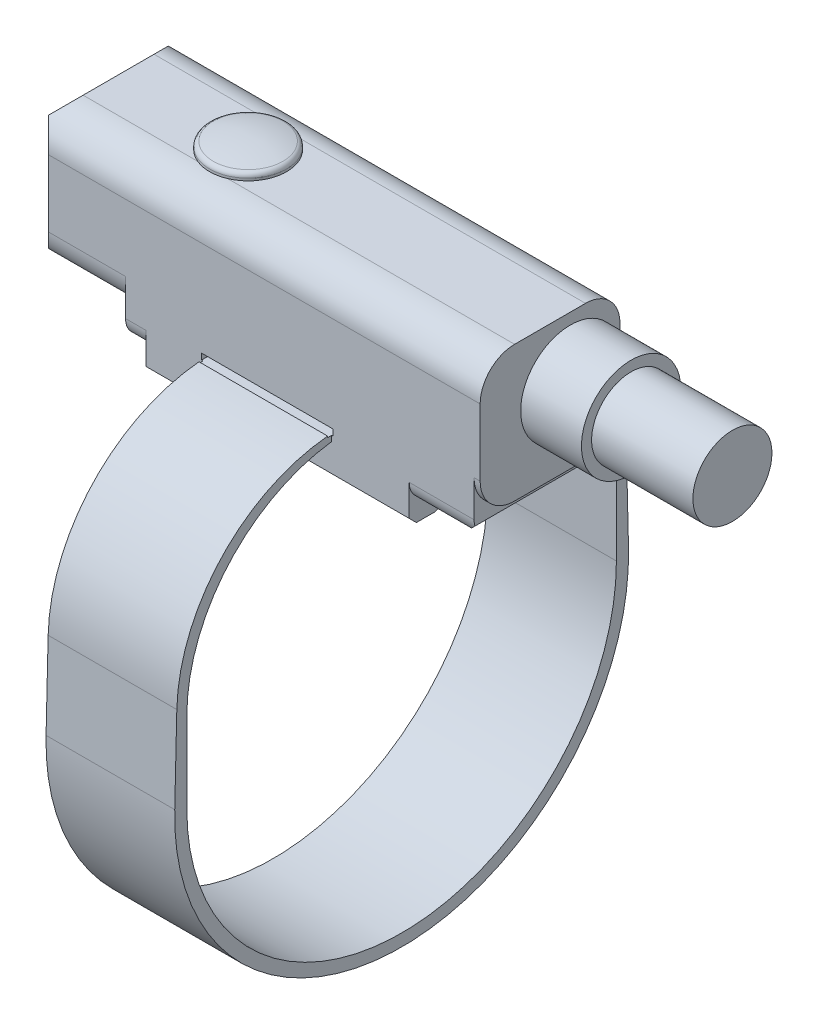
ISO-10303-21;
HEADER;
FILE_DESCRIPTION(('STEP AP214'),'2;1');
FILE_NAME('part.step','',(''),(''),'','','');
FILE_SCHEMA(('AUTOMOTIVE_DESIGN { 1 0 10303 214 1 1 1 1 }'));
ENDSEC;
DATA;
#1=APPLICATION_CONTEXT('core data for automotive mechanical design processes');
#2=APPLICATION_PROTOCOL_DEFINITION('international standard','automotive_design',2000,#1);
#3=PRODUCT_CONTEXT('',#1,'mechanical');
#4=PRODUCT('Part','Part','',(#3));
#5=PRODUCT_RELATED_PRODUCT_CATEGORY('part','',(#4));
#6=PRODUCT_DEFINITION_FORMATION('','',#4);
#7=PRODUCT_DEFINITION_CONTEXT('part definition',#1,'design');
#8=PRODUCT_DEFINITION('design','',#6,#7);
#9=PRODUCT_DEFINITION_SHAPE('','',#8);
#10=(LENGTH_UNIT() NAMED_UNIT(*) SI_UNIT(.MILLI.,.METRE.));
#11=(NAMED_UNIT(*) PLANE_ANGLE_UNIT() SI_UNIT($,.RADIAN.));
#12=(NAMED_UNIT(*) SI_UNIT($,.STERADIAN.) SOLID_ANGLE_UNIT());
#13=UNCERTAINTY_MEASURE_WITH_UNIT(LENGTH_MEASURE(1.E-05),#10,'distance_accuracy_value','');
#14=(GEOMETRIC_REPRESENTATION_CONTEXT(3) GLOBAL_UNCERTAINTY_ASSIGNED_CONTEXT((#13)) GLOBAL_UNIT_ASSIGNED_CONTEXT((#10,
#11,#12)) REPRESENTATION_CONTEXT('',''));
#15=CARTESIAN_POINT('',(0.,0.,0.));
#16=DIRECTION('',(0.,0.,1.));
#17=DIRECTION('',(1.,0.,0.));
#18=AXIS2_PLACEMENT_3D('',#15,#16,#17);
#19=CARTESIAN_POINT('',(18.5,19.1,-1.75));
#20=DIRECTION('',(0.,-1.,0.));
#21=DIRECTION('',(0.,0.,-1.));
#22=AXIS2_PLACEMENT_3D('',#19,#20,#21);
#23=PLANE('',#22);
#24=CARTESIAN_POINT('',(7.1,19.1,0.));
#25=DIRECTION('',(0.,-1.,0.));
#26=DIRECTION('',(0.,0.,-1.));
#27=AXIS2_PLACEMENT_3D('',#24,#25,#26);
#28=CIRCLE('',#27,1.9);
#29=CARTESIAN_POINT('',(6.36006757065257,19.1,1.75));
#30=VERTEX_POINT('',#29);
#31=CARTESIAN_POINT('',(6.36006757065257,19.1,-1.75));
#32=VERTEX_POINT('',#31);
#33=EDGE_CURVE('E360',#30,#32,#28,.T.);
#34=ORIENTED_EDGE('',*,*,#33,.T.);
#35=DIRECTION('',(-1.,0.,0.));
#36=VECTOR('',#35,1.);
#37=CARTESIAN_POINT('',(18.5,19.1,-1.75));
#38=LINE('',#37,#36);
#39=CARTESIAN_POINT('',(0.707106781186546,19.1,-1.75));
#40=VERTEX_POINT('',#39);
#41=EDGE_CURVE('E378',#32,#40,#38,.T.);
#42=ORIENTED_EDGE('',*,*,#41,.T.);
#43=DIRECTION('',(0.,0.,1.));
#44=VECTOR('',#43,1.);
#45=CARTESIAN_POINT('',(0.707106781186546,19.1,-5.));
#46=LINE('',#45,#44);
#47=CARTESIAN_POINT('',(0.707106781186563,19.1,1.75));
#48=VERTEX_POINT('',#47);
#49=EDGE_CURVE('E660',#40,#48,#46,.T.);
#50=ORIENTED_EDGE('',*,*,#49,.T.);
#51=DIRECTION('',(-1.,0.,0.));
#52=VECTOR('',#51,1.);
#53=CARTESIAN_POINT('',(18.5,19.1,1.75));
#54=LINE('',#53,#52);
#55=EDGE_CURVE('E513',#30,#48,#54,.T.);
#56=ORIENTED_EDGE('',*,*,#55,.F.);
#57=EDGE_LOOP('',(#34,#42,#50,#56));
#58=FACE_BOUND('',#57,.T.);
#59=ADVANCED_FACE('F16',(#58),#23,.F.);
#60=CARTESIAN_POINT('',(18.5,17.4,-1.75));
#61=DIRECTION('',(1.,0.,0.));
#62=DIRECTION('',(0.,0.,-1.));
#63=AXIS2_PLACEMENT_3D('',#60,#61,#62);
#64=PLANE('',#63);
#65=DIRECTION('',(0.,0.,-1.));
#66=VECTOR('',#65,1.);
#67=CARTESIAN_POINT('',(18.5,11.3,2.45));
#68=LINE('',#67,#66);
#69=CARTESIAN_POINT('',(18.5,11.3,2.45));
#70=VERTEX_POINT('',#69);
#71=CARTESIAN_POINT('',(18.5,11.3,-2.45));
#72=VERTEX_POINT('',#71);
#73=EDGE_CURVE('E701',#70,#72,#68,.T.);
#74=ORIENTED_EDGE('',*,*,#73,.F.);
#75=CARTESIAN_POINT('',(18.5,12.3,2.45));
#76=DIRECTION('',(1.,0.,0.));
#77=DIRECTION('',(0.,0.,-1.));
#78=AXIS2_PLACEMENT_3D('',#75,#76,#77);
#79=CIRCLE('',#78,1.);
#80=CARTESIAN_POINT('',(18.5,12.3,3.45));
#81=VERTEX_POINT('',#80);
#82=EDGE_CURVE('E681',#81,#70,#79,.T.);
#83=ORIENTED_EDGE('',*,*,#82,.F.);
#84=DIRECTION('',(0.,-1.,0.));
#85=VECTOR('',#84,1.);
#86=CARTESIAN_POINT('',(18.5,17.4,3.45));
#87=LINE('',#86,#85);
#88=CARTESIAN_POINT('',(18.5,10.7573988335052,3.45));
#89=VERTEX_POINT('',#88);
#90=EDGE_CURVE('E613',#81,#89,#87,.T.);
#91=ORIENTED_EDGE('',*,*,#90,.T.);
#92=DIRECTION('',(0.,-0.70710678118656,-0.707106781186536));
#93=VECTOR('',#92,1.);
#94=CARTESIAN_POINT('',(18.5,10.7573988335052,3.45));
#95=LINE('',#94,#93);
#96=CARTESIAN_POINT('',(18.5,10.4038454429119,3.09644660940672));
#97=VERTEX_POINT('',#96);
#98=EDGE_CURVE('E616',#89,#97,#95,.T.);
#99=ORIENTED_EDGE('',*,*,#98,.T.);
#100=DIRECTION('',(0.,0.,-1.));
#101=VECTOR('',#100,1.);
#102=CARTESIAN_POINT('',(18.5,10.4038454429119,3.09644660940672));
#103=LINE('',#102,#101);
#104=CARTESIAN_POINT('',(18.5,10.4038454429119,2.18000000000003));
#105=VERTEX_POINT('',#104);
#106=EDGE_CURVE('E820',#97,#105,#103,.T.);
#107=ORIENTED_EDGE('',*,*,#106,.T.);
#108=CARTESIAN_POINT('',(18.5,5.90411211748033,0.));
#109=DIRECTION('',(1.,0.,0.));
#110=DIRECTION('',(0.,0.,-1.));
#111=AXIS2_PLACEMENT_3D('',#108,#109,#110);
#112=CIRCLE('',#111,5.);
#113=CARTESIAN_POINT('',(18.5,10.4038454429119,-2.18000000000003));
#114=VERTEX_POINT('',#113);
#115=EDGE_CURVE('E546',#114,#105,#112,.T.);
#116=ORIENTED_EDGE('',*,*,#115,.F.);
#117=DIRECTION('',(0.,0.,-1.));
#118=VECTOR('',#117,1.);
#119=CARTESIAN_POINT('',(18.5,10.4038454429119,-2.5));
#120=LINE('',#119,#118);
#121=CARTESIAN_POINT('',(18.5,10.4038454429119,-3.09644660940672));
#122=VERTEX_POINT('',#121);
#123=EDGE_CURVE('E823',#114,#122,#120,.T.);
#124=ORIENTED_EDGE('',*,*,#123,.T.);
#125=DIRECTION('',(0.,0.70710678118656,-0.707106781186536));
#126=VECTOR('',#125,1.);
#127=CARTESIAN_POINT('',(18.5,10.4038454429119,-3.09644660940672));
#128=LINE('',#127,#126);
#129=CARTESIAN_POINT('',(18.5,10.7573988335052,-3.45));
#130=VERTEX_POINT('',#129);
#131=EDGE_CURVE('E506',#122,#130,#128,.T.);
#132=ORIENTED_EDGE('',*,*,#131,.T.);
#133=DIRECTION('',(0.,1.,0.));
#134=VECTOR('',#133,1.);
#135=CARTESIAN_POINT('',(18.5,10.7573988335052,-3.45));
#136=LINE('',#135,#134);
#137=CARTESIAN_POINT('',(18.5,12.3,-3.45));
#138=VERTEX_POINT('',#137);
#139=EDGE_CURVE('E501',#130,#138,#136,.T.);
#140=ORIENTED_EDGE('',*,*,#139,.T.);
#141=CARTESIAN_POINT('',(18.5,12.3,-2.45));
#142=DIRECTION('',(1.,0.,0.));
#143=DIRECTION('',(0.,0.,-1.));
#144=AXIS2_PLACEMENT_3D('',#141,#142,#143);
#145=CIRCLE('',#144,1.);
#146=EDGE_CURVE('E686',#72,#138,#145,.T.);
#147=ORIENTED_EDGE('',*,*,#146,.F.);
#148=EDGE_LOOP('',(#74,#83,#91,#99,#107,#116,#124,#132,#140,#147));
#149=FACE_BOUND('',#148,.T.);
#150=ADVANCED_FACE('F825',(#149),#64,.T.);
#151=CARTESIAN_POINT('',(5.5,12.3,2.45));
#152=DIRECTION('',(-1.,0.,0.));
#153=DIRECTION('',(0.,0.,1.));
#154=AXIS2_PLACEMENT_3D('',#151,#152,#153);
#155=PLANE('',#154);
#156=DIRECTION('',(0.,0.,-1.));
#157=VECTOR('',#156,1.);
#158=CARTESIAN_POINT('',(5.5,10.4038454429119,-2.5));
#159=LINE('',#158,#157);
#160=CARTESIAN_POINT('',(5.5,10.4038454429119,-2.18000000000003));
#161=VERTEX_POINT('',#160);
#162=CARTESIAN_POINT('',(5.5,10.4038454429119,-3.09644660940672));
#163=VERTEX_POINT('',#162);
#164=EDGE_CURVE('E566',#161,#163,#159,.T.);
#165=ORIENTED_EDGE('',*,*,#164,.F.);
#166=CARTESIAN_POINT('',(5.5,5.90411211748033,0.));
#167=DIRECTION('',(-1.,0.,0.));
#168=DIRECTION('',(0.,0.,1.));
#169=AXIS2_PLACEMENT_3D('',#166,#167,#168);
#170=CIRCLE('',#169,5.);
#171=CARTESIAN_POINT('',(5.5,10.4038454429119,2.18000000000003));
#172=VERTEX_POINT('',#171);
#173=EDGE_CURVE('E497',#161,#172,#170,.F.);
#174=ORIENTED_EDGE('',*,*,#173,.T.);
#175=DIRECTION('',(0.,0.,-1.));
#176=VECTOR('',#175,1.);
#177=CARTESIAN_POINT('',(5.5,10.4038454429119,3.09644660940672));
#178=LINE('',#177,#176);
#179=CARTESIAN_POINT('',(5.5,10.4038454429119,3.09644660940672));
#180=VERTEX_POINT('',#179);
#181=EDGE_CURVE('E564',#180,#172,#178,.T.);
#182=ORIENTED_EDGE('',*,*,#181,.F.);
#183=DIRECTION('',(0.,-0.70710678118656,-0.707106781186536));
#184=VECTOR('',#183,1.);
#185=CARTESIAN_POINT('',(5.5,10.7573988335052,3.45));
#186=LINE('',#185,#184);
#187=CARTESIAN_POINT('',(5.5,10.7573988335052,3.45));
#188=VERTEX_POINT('',#187);
#189=EDGE_CURVE('E561',#188,#180,#186,.T.);
#190=ORIENTED_EDGE('',*,*,#189,.F.);
#191=DIRECTION('',(0.,-1.,0.));
#192=VECTOR('',#191,1.);
#193=CARTESIAN_POINT('',(5.5,12.3,3.45));
#194=LINE('',#193,#192);
#195=CARTESIAN_POINT('',(5.5,12.3,3.45));
#196=VERTEX_POINT('',#195);
#197=EDGE_CURVE('E558',#196,#188,#194,.T.);
#198=ORIENTED_EDGE('',*,*,#197,.F.);
#199=CARTESIAN_POINT('',(5.5,12.3,2.45));
#200=DIRECTION('',(-1.,0.,0.));
#201=DIRECTION('',(0.,0.,1.));
#202=AXIS2_PLACEMENT_3D('',#199,#200,#201);
#203=CIRCLE('',#202,1.);
#204=CARTESIAN_POINT('',(5.5,11.3,2.45));
#205=VERTEX_POINT('',#204);
#206=EDGE_CURVE('E555',#205,#196,#203,.T.);
#207=ORIENTED_EDGE('',*,*,#206,.F.);
#208=DIRECTION('',(0.,0.,1.));
#209=VECTOR('',#208,1.);
#210=CARTESIAN_POINT('',(5.5,11.3,-2.45));
#211=LINE('',#210,#209);
#212=CARTESIAN_POINT('',(5.5,11.3,-2.45));
#213=VERTEX_POINT('',#212);
#214=EDGE_CURVE('E577',#213,#205,#211,.T.);
#215=ORIENTED_EDGE('',*,*,#214,.F.);
#216=CARTESIAN_POINT('',(5.5,12.3,-2.45));
#217=DIRECTION('',(-1.,0.,0.));
#218=DIRECTION('',(0.,0.,1.));
#219=AXIS2_PLACEMENT_3D('',#216,#217,#218);
#220=CIRCLE('',#219,1.);
#221=CARTESIAN_POINT('',(5.5,12.3,-3.45));
#222=VERTEX_POINT('',#221);
#223=EDGE_CURVE('E575',#222,#213,#220,.T.);
#224=ORIENTED_EDGE('',*,*,#223,.F.);
#225=DIRECTION('',(0.,1.,0.));
#226=VECTOR('',#225,1.);
#227=CARTESIAN_POINT('',(5.5,10.7573988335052,-3.45));
#228=LINE('',#227,#226);
#229=CARTESIAN_POINT('',(5.5,10.7573988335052,-3.45));
#230=VERTEX_POINT('',#229);
#231=EDGE_CURVE('E572',#230,#222,#228,.T.);
#232=ORIENTED_EDGE('',*,*,#231,.F.);
#233=DIRECTION('',(0.,0.70710678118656,-0.707106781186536));
#234=VECTOR('',#233,1.);
#235=CARTESIAN_POINT('',(5.5,10.4038454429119,-3.09644660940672));
#236=LINE('',#235,#234);
#237=EDGE_CURVE('E569',#163,#230,#236,.T.);
#238=ORIENTED_EDGE('',*,*,#237,.F.);
#239=EDGE_LOOP('',(#165,#174,#182,#190,#198,#207,#215,#224,#232,#238));
#240=FACE_BOUND('',#239,.T.);
#241=ADVANCED_FACE('F810',(#240),#155,.T.);
#242=CARTESIAN_POINT('',(18.5,17.4,3.45));
#243=DIRECTION('',(0.,0.,-1.));
#244=DIRECTION('',(-1.,0.,0.));
#245=AXIS2_PLACEMENT_3D('',#242,#243,#244);
#246=PLANE('',#245);
#247=DIRECTION('',(-1.,0.,0.));
#248=VECTOR('',#247,1.);
#249=CARTESIAN_POINT('',(18.5,17.4,3.45));
#250=LINE('',#249,#248);
#251=CARTESIAN_POINT('',(22.,17.4,3.45));
#252=VERTEX_POINT('',#251);
#253=CARTESIAN_POINT('',(0.707106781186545,17.4,3.45));
#254=VERTEX_POINT('',#253);
#255=EDGE_CURVE('E505',#252,#254,#250,.T.);
#256=ORIENTED_EDGE('',*,*,#255,.T.);
#257=DIRECTION('',(0.,1.,0.));
#258=VECTOR('',#257,1.);
#259=CARTESIAN_POINT('',(0.707106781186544,9.1,3.45));
#260=LINE('',#259,#258);
#261=CARTESIAN_POINT('',(0.707106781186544,14.1,3.45));
#262=VERTEX_POINT('',#261);
#263=EDGE_CURVE('E379',#262,#254,#260,.T.);
#264=ORIENTED_EDGE('',*,*,#263,.F.);
#265=DIRECTION('',(-1.,0.,0.));
#266=VECTOR('',#265,1.);
#267=CARTESIAN_POINT('',(4.5,14.1,3.45));
#268=LINE('',#267,#266);
#269=CARTESIAN_POINT('',(4.5,14.1,3.45));
#270=VERTEX_POINT('',#269);
#271=EDGE_CURVE('E610',#270,#262,#268,.T.);
#272=ORIENTED_EDGE('',*,*,#271,.F.);
#273=DIRECTION('',(0.,-1.,0.));
#274=VECTOR('',#273,1.);
#275=CARTESIAN_POINT('',(4.5,14.1,3.45));
#276=LINE('',#275,#274);
#277=CARTESIAN_POINT('',(4.5,12.3,3.45));
#278=VERTEX_POINT('',#277);
#279=EDGE_CURVE('E592',#270,#278,#276,.T.);
#280=ORIENTED_EDGE('',*,*,#279,.T.);
#281=DIRECTION('',(-1.,0.,0.));
#282=VECTOR('',#281,1.);
#283=CARTESIAN_POINT('',(5.5,12.3,3.45));
#284=LINE('',#283,#282);
#285=EDGE_CURVE('E587',#196,#278,#284,.T.);
#286=ORIENTED_EDGE('',*,*,#285,.F.);
#287=ORIENTED_EDGE('',*,*,#197,.T.);
#288=DIRECTION('',(-1.,0.,0.));
#289=VECTOR('',#288,1.);
#290=CARTESIAN_POINT('',(18.5,10.7573988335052,3.45));
#291=LINE('',#290,#289);
#292=EDGE_CURVE('E401',#89,#188,#291,.T.);
#293=ORIENTED_EDGE('',*,*,#292,.F.);
#294=ORIENTED_EDGE('',*,*,#90,.F.);
#295=DIRECTION('',(-1.,0.,0.));
#296=VECTOR('',#295,1.);
#297=CARTESIAN_POINT('',(21.7,12.3,3.45));
#298=LINE('',#297,#296);
#299=CARTESIAN_POINT('',(21.7,12.3,3.45));
#300=VERTEX_POINT('',#299);
#301=EDGE_CURVE('E698',#300,#81,#298,.T.);
#302=ORIENTED_EDGE('',*,*,#301,.F.);
#303=DIRECTION('',(0.,-1.,0.));
#304=VECTOR('',#303,1.);
#305=CARTESIAN_POINT('',(21.7,14.1,3.45));
#306=LINE('',#305,#304);
#307=CARTESIAN_POINT('',(21.7,14.1,3.45));
#308=VERTEX_POINT('',#307);
#309=EDGE_CURVE('E696',#308,#300,#306,.T.);
#310=ORIENTED_EDGE('',*,*,#309,.F.);
#311=DIRECTION('',(-1.,0.,0.));
#312=VECTOR('',#311,1.);
#313=CARTESIAN_POINT('',(22.,14.1,3.45));
#314=LINE('',#313,#312);
#315=CARTESIAN_POINT('',(22.,14.1,3.45));
#316=VERTEX_POINT('',#315);
#317=EDGE_CURVE('E507',#316,#308,#314,.T.);
#318=ORIENTED_EDGE('',*,*,#317,.F.);
#319=DIRECTION('',(0.,-1.,0.));
#320=VECTOR('',#319,1.);
#321=CARTESIAN_POINT('',(22.,17.4,3.45));
#322=LINE('',#321,#320);
#323=EDGE_CURVE('E532',#252,#316,#322,.T.);
#324=ORIENTED_EDGE('',*,*,#323,.F.);
#325=EDGE_LOOP('',(#256,#264,#272,#280,#286,#287,#293,#294,#302,#310,#318,#324));
#326=FACE_BOUND('',#325,.T.);
#327=DIRECTION('',(0.,1.,0.));
#328=VECTOR('',#327,1.);
#329=CARTESIAN_POINT('',(8.325,0.,3.45));
#330=LINE('',#329,#328);
#331=CARTESIAN_POINT('',(8.325,12.1324965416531,3.45));
#332=VERTEX_POINT('',#331);
#333=CARTESIAN_POINT('',(8.325,12.4,3.45));
#334=VERTEX_POINT('',#333);
#335=EDGE_CURVE('E485',#332,#334,#330,.T.);
#336=ORIENTED_EDGE('',*,*,#335,.T.);
#337=DIRECTION('',(-1.,0.,0.));
#338=VECTOR('',#337,1.);
#339=CARTESIAN_POINT('',(18.5,12.4,3.45));
#340=LINE('',#339,#338);
#341=CARTESIAN_POINT('',(8.25,12.4,3.45));
#342=VERTEX_POINT('',#341);
#343=EDGE_CURVE('E750',#334,#342,#340,.T.);
#344=ORIENTED_EDGE('',*,*,#343,.T.);
#345=DIRECTION('',(0.,-1.,0.));
#346=VECTOR('',#345,1.);
#347=CARTESIAN_POINT('',(8.25,17.4,3.45));
#348=LINE('',#347,#346);
#349=CARTESIAN_POINT('',(8.25,12.7,3.45));
#350=VERTEX_POINT('',#349);
#351=EDGE_CURVE('E741',#350,#342,#348,.T.);
#352=ORIENTED_EDGE('',*,*,#351,.F.);
#353=DIRECTION('',(1.,0.,0.));
#354=VECTOR('',#353,1.);
#355=CARTESIAN_POINT('',(18.5,12.7,3.45));
#356=LINE('',#355,#354);
#357=CARTESIAN_POINT('',(14.75,12.7,3.45));
#358=VERTEX_POINT('',#357);
#359=EDGE_CURVE('E754',#350,#358,#356,.T.);
#360=ORIENTED_EDGE('',*,*,#359,.T.);
#361=DIRECTION('',(0.,-1.,0.));
#362=VECTOR('',#361,1.);
#363=CARTESIAN_POINT('',(14.75,17.4,3.45));
#364=LINE('',#363,#362);
#365=CARTESIAN_POINT('',(14.75,12.4,3.45));
#366=VERTEX_POINT('',#365);
#367=EDGE_CURVE('E736',#358,#366,#364,.T.);
#368=ORIENTED_EDGE('',*,*,#367,.T.);
#369=CARTESIAN_POINT('',(14.675,12.4,3.45));
#370=VERTEX_POINT('',#369);
#371=EDGE_CURVE('E753',#366,#370,#340,.T.);
#372=ORIENTED_EDGE('',*,*,#371,.T.);
#373=DIRECTION('',(0.,1.,0.));
#374=VECTOR('',#373,1.);
#375=CARTESIAN_POINT('',(14.675,0.,3.45));
#376=LINE('',#375,#374);
#377=CARTESIAN_POINT('',(14.675,12.1324965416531,3.45));
#378=VERTEX_POINT('',#377);
#379=EDGE_CURVE('E411',#378,#370,#376,.T.);
#380=ORIENTED_EDGE('',*,*,#379,.F.);
#381=DIRECTION('',(-1.,0.,0.));
#382=VECTOR('',#381,1.);
#383=CARTESIAN_POINT('',(14.675,12.1324965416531,3.45));
#384=LINE('',#383,#382);
#385=EDGE_CURVE('E409',#332,#378,#384,.F.);
#386=ORIENTED_EDGE('',*,*,#385,.F.);
#387=EDGE_LOOP('',(#336,#344,#352,#360,#368,#372,#380,#386));
#388=FACE_BOUND('',#387,.T.);
#389=ADVANCED_FACE('F790',(#326,#388),#246,.F.);
#390=CARTESIAN_POINT('',(18.5,10.7573988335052,3.45));
#391=DIRECTION('',(0.,0.707106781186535,-0.70710678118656));
#392=DIRECTION('',(0.,0.70710678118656,0.707106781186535));
#393=AXIS2_PLACEMENT_3D('',#390,#391,#392);
#394=PLANE('',#393);
#395=ORIENTED_EDGE('',*,*,#189,.T.);
#396=DIRECTION('',(-1.,0.,0.));
#397=VECTOR('',#396,1.);
#398=CARTESIAN_POINT('',(18.5,10.4038454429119,3.09644660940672));
#399=LINE('',#398,#397);
#400=EDGE_CURVE('E398',#97,#180,#399,.T.);
#401=ORIENTED_EDGE('',*,*,#400,.F.);
#402=ORIENTED_EDGE('',*,*,#98,.F.);
#403=ORIENTED_EDGE('',*,*,#292,.T.);
#404=EDGE_LOOP('',(#395,#401,#402,#403));
#405=FACE_BOUND('',#404,.T.);
#406=ADVANCED_FACE('F814',(#405),#394,.F.);
#407=CARTESIAN_POINT('',(18.5,10.4038454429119,3.09644660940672));
#408=DIRECTION('',(0.,1.,0.));
#409=DIRECTION('',(0.,0.,1.));
#410=AXIS2_PLACEMENT_3D('',#407,#408,#409);
#411=PLANE('',#410);
#412=ORIENTED_EDGE('',*,*,#181,.T.);
#413=DIRECTION('',(-1.,0.,0.));
#414=VECTOR('',#413,1.);
#415=CARTESIAN_POINT('',(18.5,10.4038454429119,2.18000000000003));
#416=LINE('',#415,#414);
#417=EDGE_CURVE('E549',#105,#172,#416,.T.);
#418=ORIENTED_EDGE('',*,*,#417,.F.);
#419=ORIENTED_EDGE('',*,*,#106,.F.);
#420=ORIENTED_EDGE('',*,*,#400,.T.);
#421=EDGE_LOOP('',(#412,#418,#419,#420));
#422=FACE_BOUND('',#421,.T.);
#423=ADVANCED_FACE('F818',(#422),#411,.F.);
#424=CARTESIAN_POINT('',(18.5,10.4038454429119,-2.5));
#425=DIRECTION('',(0.,1.,0.));
#426=DIRECTION('',(0.,0.,1.));
#427=AXIS2_PLACEMENT_3D('',#424,#425,#426);
#428=PLANE('',#427);
#429=ORIENTED_EDGE('',*,*,#164,.T.);
#430=DIRECTION('',(-1.,0.,0.));
#431=VECTOR('',#430,1.);
#432=CARTESIAN_POINT('',(18.5,10.4038454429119,-3.09644660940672));
#433=LINE('',#432,#431);
#434=EDGE_CURVE('E395',#122,#163,#433,.T.);
#435=ORIENTED_EDGE('',*,*,#434,.F.);
#436=ORIENTED_EDGE('',*,*,#123,.F.);
#437=DIRECTION('',(-1.,0.,0.));
#438=VECTOR('',#437,1.);
#439=CARTESIAN_POINT('',(18.5,10.4038454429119,-2.18000000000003));
#440=LINE('',#439,#438);
#441=EDGE_CURVE('E552',#114,#161,#440,.T.);
#442=ORIENTED_EDGE('',*,*,#441,.T.);
#443=EDGE_LOOP('',(#429,#435,#436,#442));
#444=FACE_BOUND('',#443,.T.);
#445=ADVANCED_FACE('F991',(#444),#428,.F.);
#446=CARTESIAN_POINT('',(18.5,10.4038454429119,-3.09644660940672));
#447=DIRECTION('',(0.,0.707106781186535,0.70710678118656));
#448=DIRECTION('',(0.,-0.70710678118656,0.707106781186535));
#449=AXIS2_PLACEMENT_3D('',#446,#447,#448);
#450=PLANE('',#449);
#451=ORIENTED_EDGE('',*,*,#237,.T.);
#452=DIRECTION('',(-1.,0.,0.));
#453=VECTOR('',#452,1.);
#454=CARTESIAN_POINT('',(18.5,10.7573988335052,-3.45));
#455=LINE('',#454,#453);
#456=EDGE_CURVE('E387',#130,#230,#455,.T.);
#457=ORIENTED_EDGE('',*,*,#456,.F.);
#458=ORIENTED_EDGE('',*,*,#131,.F.);
#459=ORIENTED_EDGE('',*,*,#434,.T.);
#460=EDGE_LOOP('',(#451,#457,#458,#459));
#461=FACE_BOUND('',#460,.T.);
#462=ADVANCED_FACE('F988',(#461),#450,.F.);
#463=CARTESIAN_POINT('',(4.5,14.1,1.75));
#464=DIRECTION('',(-1.,0.,0.));
#465=DIRECTION('',(0.,0.,1.));
#466=AXIS2_PLACEMENT_3D('',#463,#464,#465);
#467=PLANE('',#466);
#468=DIRECTION('',(0.,0.,1.));
#469=VECTOR('',#468,1.);
#470=CARTESIAN_POINT('',(4.5,11.3,1.75));
#471=LINE('',#470,#469);
#472=CARTESIAN_POINT('',(4.5,11.3,-2.45));
#473=VERTEX_POINT('',#472);
#474=CARTESIAN_POINT('',(4.5,11.3,2.45));
#475=VERTEX_POINT('',#474);
#476=EDGE_CURVE('E488',#473,#475,#471,.T.);
#477=ORIENTED_EDGE('',*,*,#476,.T.);
#478=CARTESIAN_POINT('',(4.5,12.3,2.45));
#479=DIRECTION('',(-1.,0.,0.));
#480=DIRECTION('',(0.,0.,1.));
#481=AXIS2_PLACEMENT_3D('',#478,#479,#480);
#482=CIRCLE('',#481,1.);
#483=EDGE_CURVE('E494',#475,#278,#482,.T.);
#484=ORIENTED_EDGE('',*,*,#483,.T.);
#485=ORIENTED_EDGE('',*,*,#279,.F.);
#486=CARTESIAN_POINT('',(4.5,14.1,1.75));
#487=DIRECTION('',(-1.,0.,0.));
#488=DIRECTION('',(0.,0.,1.));
#489=AXIS2_PLACEMENT_3D('',#486,#487,#488);
#490=CIRCLE('',#489,1.7);
#491=CARTESIAN_POINT('',(4.5,12.4,1.75));
#492=VERTEX_POINT('',#491);
#493=EDGE_CURVE('E589',#492,#270,#490,.T.);
#494=ORIENTED_EDGE('',*,*,#493,.F.);
#495=DIRECTION('',(0.,0.,1.));
#496=VECTOR('',#495,1.);
#497=CARTESIAN_POINT('',(4.5,12.4,-1.75));
#498=LINE('',#497,#496);
#499=CARTESIAN_POINT('',(4.5,12.4,-1.75));
#500=VERTEX_POINT('',#499);
#501=EDGE_CURVE('E599',#500,#492,#498,.T.);
#502=ORIENTED_EDGE('',*,*,#501,.F.);
#503=CARTESIAN_POINT('',(4.5,14.1,-1.75));
#504=DIRECTION('',(-1.,0.,0.));
#505=DIRECTION('',(0.,0.,1.));
#506=AXIS2_PLACEMENT_3D('',#503,#504,#505);
#507=CIRCLE('',#506,1.7);
#508=CARTESIAN_POINT('',(4.5,14.1,-3.45));
#509=VERTEX_POINT('',#508);
#510=EDGE_CURVE('E597',#509,#500,#507,.T.);
#511=ORIENTED_EDGE('',*,*,#510,.F.);
#512=DIRECTION('',(0.,1.,0.));
#513=VECTOR('',#512,1.);
#514=CARTESIAN_POINT('',(4.5,10.7573988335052,-3.45));
#515=LINE('',#514,#513);
#516=CARTESIAN_POINT('',(4.5,12.3,-3.45));
#517=VERTEX_POINT('',#516);
#518=EDGE_CURVE('E595',#517,#509,#515,.T.);
#519=ORIENTED_EDGE('',*,*,#518,.F.);
#520=CARTESIAN_POINT('',(4.5,12.3,-2.45));
#521=DIRECTION('',(-1.,0.,0.));
#522=DIRECTION('',(0.,0.,1.));
#523=AXIS2_PLACEMENT_3D('',#520,#521,#522);
#524=CIRCLE('',#523,1.);
#525=EDGE_CURVE('E491',#517,#473,#524,.T.);
#526=ORIENTED_EDGE('',*,*,#525,.T.);
#527=EDGE_LOOP('',(#477,#484,#485,#494,#502,#511,#519,#526));
#528=FACE_BOUND('',#527,.T.);
#529=ADVANCED_FACE('F799',(#528),#467,.T.);
#530=CARTESIAN_POINT('',(0.,17.4,-1.75));
#531=DIRECTION('',(1.,0.,0.));
#532=DIRECTION('',(0.,0.,-1.));
#533=AXIS2_PLACEMENT_3D('',#530,#531,#532);
#534=PLANE('',#533);
#535=DIRECTION('',(0.,0.,1.));
#536=VECTOR('',#535,1.);
#537=CARTESIAN_POINT('',(0.,18.3928932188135,-5.));
#538=LINE('',#537,#536);
#539=CARTESIAN_POINT('',(0.,18.3928932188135,-2.74289321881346));
#540=VERTEX_POINT('',#539);
#541=CARTESIAN_POINT('',(0.,18.3928932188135,2.74289321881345));
#542=VERTEX_POINT('',#541);
#543=EDGE_CURVE('E636',#540,#542,#538,.T.);
#544=ORIENTED_EDGE('',*,*,#543,.F.);
#545=DIRECTION('',(0.,1.,0.));
#546=VECTOR('',#545,1.);
#547=CARTESIAN_POINT('',(0.,9.1,-2.74289321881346));
#548=LINE('',#547,#546);
#549=CARTESIAN_POINT('',(0.,13.1071067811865,-2.74289321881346));
#550=VERTEX_POINT('',#549);
#551=EDGE_CURVE('E645',#550,#540,#548,.T.);
#552=ORIENTED_EDGE('',*,*,#551,.F.);
#553=DIRECTION('',(0.,0.,1.));
#554=VECTOR('',#553,1.);
#555=CARTESIAN_POINT('',(0.,13.1071067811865,-5.));
#556=LINE('',#555,#554);
#557=CARTESIAN_POINT('',(0.,13.1071067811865,2.74289321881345));
#558=VERTEX_POINT('',#557);
#559=EDGE_CURVE('E659',#550,#558,#556,.T.);
#560=ORIENTED_EDGE('',*,*,#559,.T.);
#561=DIRECTION('',(0.,1.,0.));
#562=VECTOR('',#561,1.);
#563=CARTESIAN_POINT('',(0.,9.1,2.74289321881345));
#564=LINE('',#563,#562);
#565=EDGE_CURVE('E785',#558,#542,#564,.T.);
#566=ORIENTED_EDGE('',*,*,#565,.T.);
#567=EDGE_LOOP('',(#544,#552,#560,#566));
#568=FACE_BOUND('',#567,.T.);
#569=ADVANCED_FACE('F1012',(#568),#534,.F.);
#570=CARTESIAN_POINT('',(14.675,0.,0.));
#571=DIRECTION('',(1.,0.,0.));
#572=DIRECTION('',(0.,0.,-1.));
#573=AXIS2_PLACEMENT_3D('',#570,#571,#572);
#574=PLANE('',#573);
#575=DIRECTION('',(0.,-1.,0.));
#576=VECTOR('',#575,1.);
#577=CARTESIAN_POINT('',(14.675,0.,3.65));
#578=LINE('',#577,#576);
#579=CARTESIAN_POINT('',(14.675,12.4653114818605,3.65));
#580=VERTEX_POINT('',#579);
#581=CARTESIAN_POINT('',(14.675,12.4,3.65));
#582=VERTEX_POINT('',#581);
#583=EDGE_CURVE('E765',#580,#582,#578,.T.);
#584=ORIENTED_EDGE('',*,*,#583,.F.);
#585=CARTESIAN_POINT('',(14.675,4.3,2.89654900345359));
#586=DIRECTION('',(1.,0.,0.));
#587=DIRECTION('',(0.,0.,-1.));
#588=AXIS2_PLACEMENT_3D('',#585,#586,#587);
#589=CIRCLE('',#588,8.2);
#590=CARTESIAN_POINT('',(14.675,4.49890389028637,11.0941362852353));
#591=VERTEX_POINT('',#590);
#592=EDGE_CURVE('E470',#580,#591,#589,.T.);
#593=ORIENTED_EDGE('',*,*,#592,.T.);
#594=DIRECTION('',(0.,-0.999705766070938,0.024256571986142));
#595=VECTOR('',#594,1.);
#596=CARTESIAN_POINT('',(14.675,4.49890389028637,11.0941362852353));
#597=LINE('',#596,#595);
#598=CARTESIAN_POINT('',(14.675,0.271673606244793,11.1967045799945));
#599=VERTEX_POINT('',#598);
#600=EDGE_CURVE('E472',#591,#599,#597,.T.);
#601=ORIENTED_EDGE('',*,*,#600,.T.);
#602=CARTESIAN_POINT('',(14.675,0.,0.));
#603=DIRECTION('',(1.,0.,0.));
#604=DIRECTION('',(0.,0.,-1.));
#605=AXIS2_PLACEMENT_3D('',#602,#603,#604);
#606=CIRCLE('',#605,11.2);
#607=CARTESIAN_POINT('',(14.675,0.271673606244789,-11.1967045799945));
#608=VERTEX_POINT('',#607);
#609=EDGE_CURVE('E462',#599,#608,#606,.T.);
#610=ORIENTED_EDGE('',*,*,#609,.T.);
#611=DIRECTION('',(0.,0.999705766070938,0.0242565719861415));
#612=VECTOR('',#611,1.);
#613=CARTESIAN_POINT('',(14.675,0.271673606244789,-11.1967045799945));
#614=LINE('',#613,#612);
#615=CARTESIAN_POINT('',(14.675,4.49890389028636,-11.0941362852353));
#616=VERTEX_POINT('',#615);
#617=EDGE_CURVE('E465',#608,#616,#614,.T.);
#618=ORIENTED_EDGE('',*,*,#617,.T.);
#619=CARTESIAN_POINT('',(14.675,4.3,-2.89654900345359));
#620=DIRECTION('',(1.,0.,0.));
#621=DIRECTION('',(0.,0.,-1.));
#622=AXIS2_PLACEMENT_3D('',#619,#620,#621);
#623=CIRCLE('',#622,8.2);
#624=CARTESIAN_POINT('',(14.675,12.4653114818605,-3.65));
#625=VERTEX_POINT('',#624);
#626=EDGE_CURVE('E467',#616,#625,#623,.T.);
#627=ORIENTED_EDGE('',*,*,#626,.T.);
#628=DIRECTION('',(0.,1.,0.));
#629=VECTOR('',#628,1.);
#630=CARTESIAN_POINT('',(14.675,0.,-3.65));
#631=LINE('',#630,#629);
#632=CARTESIAN_POINT('',(14.675,12.4,-3.65));
#633=VERTEX_POINT('',#632);
#634=EDGE_CURVE('E760',#633,#625,#631,.T.);
#635=ORIENTED_EDGE('',*,*,#634,.F.);
#636=DIRECTION('',(0.,0.,-1.));
#637=VECTOR('',#636,1.);
#638=CARTESIAN_POINT('',(14.675,12.4,0.));
#639=LINE('',#638,#637);
#640=CARTESIAN_POINT('',(14.675,12.4,-3.45));
#641=VERTEX_POINT('',#640);
#642=EDGE_CURVE('E743',#641,#633,#639,.T.);
#643=ORIENTED_EDGE('',*,*,#642,.F.);
#644=DIRECTION('',(0.,-1.,0.));
#645=VECTOR('',#644,1.);
#646=CARTESIAN_POINT('',(14.675,0.,-3.45));
#647=LINE('',#646,#645);
#648=CARTESIAN_POINT('',(14.675,12.1324965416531,-3.45));
#649=VERTEX_POINT('',#648);
#650=EDGE_CURVE('E407',#641,#649,#647,.T.);
#651=ORIENTED_EDGE('',*,*,#650,.T.);
#652=CARTESIAN_POINT('',(14.675,4.,-2.4));
#653=DIRECTION('',(1.,0.,0.));
#654=DIRECTION('',(0.,0.,-1.));
#655=AXIS2_PLACEMENT_3D('',#652,#653,#654);
#656=CIRCLE('',#655,8.2);
#657=CARTESIAN_POINT('',(14.675,4.,-10.6));
#658=VERTEX_POINT('',#657);
#659=EDGE_CURVE('E450',#658,#649,#656,.T.);
#660=ORIENTED_EDGE('',*,*,#659,.F.);
#661=DIRECTION('',(0.,1.,0.));
#662=VECTOR('',#661,1.);
#663=CARTESIAN_POINT('',(14.675,0.,-10.6));
#664=LINE('',#663,#662);
#665=CARTESIAN_POINT('',(14.675,0.,-10.6));
#666=VERTEX_POINT('',#665);
#667=EDGE_CURVE('E448',#666,#658,#664,.T.);
#668=ORIENTED_EDGE('',*,*,#667,.F.);
#669=CARTESIAN_POINT('',(14.675,0.,0.));
#670=DIRECTION('',(1.,0.,0.));
#671=DIRECTION('',(0.,0.,-1.));
#672=AXIS2_PLACEMENT_3D('',#669,#670,#671);
#673=CIRCLE('',#672,10.6);
#674=CARTESIAN_POINT('',(14.675,0.,10.6));
#675=VERTEX_POINT('',#674);
#676=EDGE_CURVE('E446',#675,#666,#673,.T.);
#677=ORIENTED_EDGE('',*,*,#676,.F.);
#678=DIRECTION('',(0.,-1.,0.));
#679=VECTOR('',#678,1.);
#680=CARTESIAN_POINT('',(14.675,4.,10.6));
#681=LINE('',#680,#679);
#682=CARTESIAN_POINT('',(14.675,4.,10.6));
#683=VERTEX_POINT('',#682);
#684=EDGE_CURVE('E444',#683,#675,#681,.T.);
#685=ORIENTED_EDGE('',*,*,#684,.F.);
#686=CARTESIAN_POINT('',(14.675,4.,2.4));
#687=DIRECTION('',(1.,0.,0.));
#688=DIRECTION('',(0.,0.,-1.));
#689=AXIS2_PLACEMENT_3D('',#686,#687,#688);
#690=CIRCLE('',#689,8.2);
#691=EDGE_CURVE('E442',#378,#683,#690,.T.);
#692=ORIENTED_EDGE('',*,*,#691,.F.);
#693=ORIENTED_EDGE('',*,*,#379,.T.);
#694=EDGE_CURVE('E746',#582,#370,#639,.T.);
#695=ORIENTED_EDGE('',*,*,#694,.F.);
#696=EDGE_LOOP('',(#584,#593,#601,#610,#618,#627,#635,#643,#651,#660,#668,#677,#685,#692,#693,#695));
#697=FACE_BOUND('',#696,.T.);
#698=ADVANCED_FACE('F888',(#697),#574,.T.);
#699=CARTESIAN_POINT('',(14.675,4.3,-2.89654900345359));
#700=DIRECTION('',(-1.,0.,0.));
#701=DIRECTION('',(0.,0.,1.));
#702=AXIS2_PLACEMENT_3D('',#699,#700,#701);
#703=CYLINDRICAL_SURFACE('',#702,8.2);
#704=CARTESIAN_POINT('',(8.325,4.3,-2.89654900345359));
#705=DIRECTION('',(1.,0.,0.));
#706=DIRECTION('',(0.,0.,-1.));
#707=AXIS2_PLACEMENT_3D('',#704,#705,#706);
#708=CIRCLE('',#707,8.2);
#709=CARTESIAN_POINT('',(8.325,4.49890389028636,-11.0941362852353));
#710=VERTEX_POINT('',#709);
#711=CARTESIAN_POINT('',(8.325,12.4653114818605,-3.65));
#712=VERTEX_POINT('',#711);
#713=EDGE_CURVE('E434',#710,#712,#708,.T.);
#714=ORIENTED_EDGE('',*,*,#713,.T.);
#715=DIRECTION('',(-1.,0.,0.));
#716=VECTOR('',#715,1.);
#717=CARTESIAN_POINT('',(14.675,12.4653114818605,-3.65));
#718=LINE('',#717,#716);
#719=EDGE_CURVE('E757',#712,#625,#718,.F.);
#720=ORIENTED_EDGE('',*,*,#719,.T.);
#721=ORIENTED_EDGE('',*,*,#626,.F.);
#722=DIRECTION('',(-1.,0.,0.));
#723=VECTOR('',#722,1.);
#724=CARTESIAN_POINT('',(14.675,4.49890389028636,-11.0941362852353));
#725=LINE('',#724,#723);
#726=EDGE_CURVE('E479',#616,#710,#725,.T.);
#727=ORIENTED_EDGE('',*,*,#726,.T.);
#728=EDGE_LOOP('',(#714,#720,#721,#727));
#729=FACE_BOUND('',#728,.T.);
#730=ADVANCED_FACE('F945',(#729),#703,.T.);
#731=CARTESIAN_POINT('',(14.675,4.3,2.89654900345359));
#732=DIRECTION('',(-1.,0.,0.));
#733=DIRECTION('',(0.,0.,1.));
#734=AXIS2_PLACEMENT_3D('',#731,#732,#733);
#735=CYLINDRICAL_SURFACE('',#734,8.2);
#736=ORIENTED_EDGE('',*,*,#592,.F.);
#737=DIRECTION('',(-1.,0.,0.));
#738=VECTOR('',#737,1.);
#739=CARTESIAN_POINT('',(14.675,12.4653114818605,3.65));
#740=LINE('',#739,#738);
#741=CARTESIAN_POINT('',(8.325,12.4653114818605,3.65));
#742=VERTEX_POINT('',#741);
#743=EDGE_CURVE('E762',#580,#742,#740,.T.);
#744=ORIENTED_EDGE('',*,*,#743,.T.);
#745=CARTESIAN_POINT('',(8.325,4.3,2.89654900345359));
#746=DIRECTION('',(1.,0.,0.));
#747=DIRECTION('',(0.,0.,-1.));
#748=AXIS2_PLACEMENT_3D('',#745,#746,#747);
#749=CIRCLE('',#748,8.2);
#750=CARTESIAN_POINT('',(8.325,4.49890389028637,11.0941362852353));
#751=VERTEX_POINT('',#750);
#752=EDGE_CURVE('E437',#742,#751,#749,.T.);
#753=ORIENTED_EDGE('',*,*,#752,.T.);
#754=DIRECTION('',(-1.,0.,0.));
#755=VECTOR('',#754,1.);
#756=CARTESIAN_POINT('',(14.675,4.49890389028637,11.0941362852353));
#757=LINE('',#756,#755);
#758=EDGE_CURVE('E476',#591,#751,#757,.T.);
#759=ORIENTED_EDGE('',*,*,#758,.F.);
#760=EDGE_LOOP('',(#736,#744,#753,#759));
#761=FACE_BOUND('',#760,.T.);
#762=ADVANCED_FACE('F884',(#761),#735,.T.);
#763=CARTESIAN_POINT('',(14.675,4.,2.4));
#764=DIRECTION('',(-1.,0.,0.));
#765=DIRECTION('',(0.,0.,1.));
#766=AXIS2_PLACEMENT_3D('',#763,#764,#765);
#767=CYLINDRICAL_SURFACE('',#766,8.2);
#768=CARTESIAN_POINT('',(8.325,4.,2.4));
#769=DIRECTION('',(1.,0.,0.));
#770=DIRECTION('',(0.,0.,-1.));
#771=AXIS2_PLACEMENT_3D('',#768,#769,#770);
#772=CIRCLE('',#771,8.2);
#773=CARTESIAN_POINT('',(8.325,4.,10.6));
#774=VERTEX_POINT('',#773);
#775=EDGE_CURVE('E414',#332,#774,#772,.T.);
#776=ORIENTED_EDGE('',*,*,#775,.F.);
#777=ORIENTED_EDGE('',*,*,#385,.T.);
#778=ORIENTED_EDGE('',*,*,#691,.T.);
#779=DIRECTION('',(-1.,0.,0.));
#780=VECTOR('',#779,1.);
#781=CARTESIAN_POINT('',(14.675,4.,10.6));
#782=LINE('',#781,#780);
#783=EDGE_CURVE('E459',#683,#774,#782,.T.);
#784=ORIENTED_EDGE('',*,*,#783,.T.);
#785=EDGE_LOOP('',(#776,#777,#778,#784));
#786=FACE_BOUND('',#785,.T.);
#787=ADVANCED_FACE('F900',(#786),#767,.F.);
#788=CARTESIAN_POINT('',(14.675,4.,-2.4));
#789=DIRECTION('',(-1.,0.,0.));
#790=DIRECTION('',(0.,0.,1.));
#791=AXIS2_PLACEMENT_3D('',#788,#789,#790);
#792=CYLINDRICAL_SURFACE('',#791,8.2);
#793=ORIENTED_EDGE('',*,*,#659,.T.);
#794=DIRECTION('',(-1.,0.,0.));
#795=VECTOR('',#794,1.);
#796=CARTESIAN_POINT('',(14.675,12.1324965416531,-3.45));
#797=LINE('',#796,#795);
#798=CARTESIAN_POINT('',(8.325,12.1324965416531,-3.45));
#799=VERTEX_POINT('',#798);
#800=EDGE_CURVE('E404',#649,#799,#797,.T.);
#801=ORIENTED_EDGE('',*,*,#800,.T.);
#802=CARTESIAN_POINT('',(8.325,4.,-2.4));
#803=DIRECTION('',(1.,0.,0.));
#804=DIRECTION('',(0.,0.,-1.));
#805=AXIS2_PLACEMENT_3D('',#802,#803,#804);
#806=CIRCLE('',#805,8.2);
#807=CARTESIAN_POINT('',(8.325,4.,-10.6));
#808=VERTEX_POINT('',#807);
#809=EDGE_CURVE('E425',#808,#799,#806,.T.);
#810=ORIENTED_EDGE('',*,*,#809,.F.);
#811=DIRECTION('',(-1.,0.,0.));
#812=VECTOR('',#811,1.);
#813=CARTESIAN_POINT('',(14.675,4.,-10.6));
#814=LINE('',#813,#812);
#815=EDGE_CURVE('E453',#658,#808,#814,.T.);
#816=ORIENTED_EDGE('',*,*,#815,.F.);
#817=EDGE_LOOP('',(#793,#801,#810,#816));
#818=FACE_BOUND('',#817,.T.);
#819=ADVANCED_FACE('F921',(#818),#792,.F.);
#820=CARTESIAN_POINT('',(8.325,0.,0.));
#821=DIRECTION('',(1.,0.,0.));
#822=DIRECTION('',(0.,0.,-1.));
#823=AXIS2_PLACEMENT_3D('',#820,#821,#822);
#824=PLANE('',#823);
#825=ORIENTED_EDGE('',*,*,#752,.F.);
#826=DIRECTION('',(0.,-1.,0.));
#827=VECTOR('',#826,1.);
#828=CARTESIAN_POINT('',(8.325,0.,3.65));
#829=LINE('',#828,#827);
#830=CARTESIAN_POINT('',(8.325,12.4,3.65));
#831=VERTEX_POINT('',#830);
#832=EDGE_CURVE('E626',#742,#831,#829,.T.);
#833=ORIENTED_EDGE('',*,*,#832,.T.);
#834=DIRECTION('',(0.,0.,-1.));
#835=VECTOR('',#834,1.);
#836=CARTESIAN_POINT('',(8.325,12.4,0.));
#837=LINE('',#836,#835);
#838=EDGE_CURVE('E749',#831,#334,#837,.T.);
#839=ORIENTED_EDGE('',*,*,#838,.T.);
#840=ORIENTED_EDGE('',*,*,#335,.F.);
#841=ORIENTED_EDGE('',*,*,#775,.T.);
#842=DIRECTION('',(0.,-1.,0.));
#843=VECTOR('',#842,1.);
#844=CARTESIAN_POINT('',(8.325,4.,10.6));
#845=LINE('',#844,#843);
#846=CARTESIAN_POINT('',(8.325,0.,10.6));
#847=VERTEX_POINT('',#846);
#848=EDGE_CURVE('E416',#774,#847,#845,.T.);
#849=ORIENTED_EDGE('',*,*,#848,.T.);
#850=CARTESIAN_POINT('',(8.325,0.,0.));
#851=DIRECTION('',(1.,0.,0.));
#852=DIRECTION('',(0.,0.,-1.));
#853=AXIS2_PLACEMENT_3D('',#850,#851,#852);
#854=CIRCLE('',#853,10.6);
#855=CARTESIAN_POINT('',(8.325,0.,-10.6));
#856=VERTEX_POINT('',#855);
#857=EDGE_CURVE('E419',#847,#856,#854,.T.);
#858=ORIENTED_EDGE('',*,*,#857,.T.);
#859=DIRECTION('',(0.,1.,0.));
#860=VECTOR('',#859,1.);
#861=CARTESIAN_POINT('',(8.325,0.,-10.6));
#862=LINE('',#861,#860);
#863=EDGE_CURVE('E422',#856,#808,#862,.T.);
#864=ORIENTED_EDGE('',*,*,#863,.T.);
#865=ORIENTED_EDGE('',*,*,#809,.T.);
#866=DIRECTION('',(0.,-1.,0.));
#867=VECTOR('',#866,1.);
#868=CARTESIAN_POINT('',(8.325,0.,-3.45));
#869=LINE('',#868,#867);
#870=CARTESIAN_POINT('',(8.325,12.4,-3.45));
#871=VERTEX_POINT('',#870);
#872=EDGE_CURVE('E483',#871,#799,#869,.T.);
#873=ORIENTED_EDGE('',*,*,#872,.F.);
#874=CARTESIAN_POINT('',(8.325,12.4,-3.65));
#875=VERTEX_POINT('',#874);
#876=EDGE_CURVE('E745',#871,#875,#837,.T.);
#877=ORIENTED_EDGE('',*,*,#876,.T.);
#878=DIRECTION('',(0.,1.,0.));
#879=VECTOR('',#878,1.);
#880=CARTESIAN_POINT('',(8.325,0.,-3.65));
#881=LINE('',#880,#879);
#882=EDGE_CURVE('E869',#875,#712,#881,.T.);
#883=ORIENTED_EDGE('',*,*,#882,.T.);
#884=ORIENTED_EDGE('',*,*,#713,.F.);
#885=DIRECTION('',(0.,0.999705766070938,0.0242565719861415));
#886=VECTOR('',#885,1.);
#887=CARTESIAN_POINT('',(8.325,0.271673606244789,-11.1967045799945));
#888=LINE('',#887,#886);
#889=CARTESIAN_POINT('',(8.325,0.271673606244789,-11.1967045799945));
#890=VERTEX_POINT('',#889);
#891=EDGE_CURVE('E431',#890,#710,#888,.T.);
#892=ORIENTED_EDGE('',*,*,#891,.F.);
#893=CARTESIAN_POINT('',(8.325,0.,0.));
#894=DIRECTION('',(1.,0.,0.));
#895=DIRECTION('',(0.,0.,-1.));
#896=AXIS2_PLACEMENT_3D('',#893,#894,#895);
#897=CIRCLE('',#896,11.2);
#898=CARTESIAN_POINT('',(8.325,0.271673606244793,11.1967045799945));
#899=VERTEX_POINT('',#898);
#900=EDGE_CURVE('E428',#899,#890,#897,.T.);
#901=ORIENTED_EDGE('',*,*,#900,.F.);
#902=DIRECTION('',(0.,-0.999705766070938,0.024256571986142));
#903=VECTOR('',#902,1.);
#904=CARTESIAN_POINT('',(8.325,4.49890389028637,11.0941362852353));
#905=LINE('',#904,#903);
#906=EDGE_CURVE('E439',#751,#899,#905,.T.);
#907=ORIENTED_EDGE('',*,*,#906,.F.);
#908=EDGE_LOOP('',(#825,#833,#839,#840,#841,#849,#858,#864,#865,#873,#877,#883,#884,#892,#901,#907));
#909=FACE_BOUND('',#908,.T.);
#910=ADVANCED_FACE('F876',(#909),#824,.F.);
#911=CARTESIAN_POINT('',(14.675,0.,0.));
#912=DIRECTION('',(-1.,0.,0.));
#913=DIRECTION('',(0.,0.,1.));
#914=AXIS2_PLACEMENT_3D('',#911,#912,#913);
#915=CYLINDRICAL_SURFACE('',#914,11.2);
#916=DIRECTION('',(-1.,0.,0.));
#917=VECTOR('',#916,1.);
#918=CARTESIAN_POINT('',(14.675,0.271673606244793,11.1967045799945));
#919=LINE('',#918,#917);
#920=EDGE_CURVE('E474',#599,#899,#919,.T.);
#921=ORIENTED_EDGE('',*,*,#920,.T.);
#922=ORIENTED_EDGE('',*,*,#900,.T.);
#923=DIRECTION('',(-1.,0.,0.));
#924=VECTOR('',#923,1.);
#925=CARTESIAN_POINT('',(14.675,0.271673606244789,-11.1967045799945));
#926=LINE('',#925,#924);
#927=EDGE_CURVE('E481',#608,#890,#926,.T.);
#928=ORIENTED_EDGE('',*,*,#927,.F.);
#929=ORIENTED_EDGE('',*,*,#609,.F.);
#930=EDGE_LOOP('',(#921,#922,#928,#929));
#931=FACE_BOUND('',#930,.T.);
#932=ADVANCED_FACE('F18',(#931),#915,.T.);
#933=CARTESIAN_POINT('',(14.675,0.271673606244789,-11.1967045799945));
#934=DIRECTION('',(0.,-0.0242565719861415,0.999705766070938));
#935=DIRECTION('',(0.,-0.999705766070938,-0.0242565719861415));
#936=AXIS2_PLACEMENT_3D('',#933,#934,#935);
#937=PLANE('',#936);
#938=ORIENTED_EDGE('',*,*,#927,.T.);
#939=ORIENTED_EDGE('',*,*,#891,.T.);
#940=ORIENTED_EDGE('',*,*,#726,.F.);
#941=ORIENTED_EDGE('',*,*,#617,.F.);
#942=EDGE_LOOP('',(#938,#939,#940,#941));
#943=FACE_BOUND('',#942,.T.);
#944=ADVANCED_FACE('F949',(#943),#937,.F.);
#945=CARTESIAN_POINT('',(14.675,4.49890389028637,11.0941362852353));
#946=DIRECTION('',(0.,-0.024256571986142,-0.999705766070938));
#947=DIRECTION('',(0.,0.999705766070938,-0.024256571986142));
#948=AXIS2_PLACEMENT_3D('',#945,#946,#947);
#949=PLANE('',#948);
#950=ORIENTED_EDGE('',*,*,#758,.T.);
#951=ORIENTED_EDGE('',*,*,#906,.T.);
#952=ORIENTED_EDGE('',*,*,#920,.F.);
#953=ORIENTED_EDGE('',*,*,#600,.F.);
#954=EDGE_LOOP('',(#950,#951,#952,#953));
#955=FACE_BOUND('',#954,.T.);
#956=ADVANCED_FACE('F955',(#955),#949,.F.);
#957=CARTESIAN_POINT('',(14.675,4.,10.6));
#958=DIRECTION('',(0.,0.,-1.));
#959=DIRECTION('',(-1.,0.,0.));
#960=AXIS2_PLACEMENT_3D('',#957,#958,#959);
#961=PLANE('',#960);
#962=DIRECTION('',(-1.,0.,0.));
#963=VECTOR('',#962,1.);
#964=CARTESIAN_POINT('',(14.675,0.,10.6));
#965=LINE('',#964,#963);
#966=EDGE_CURVE('E457',#675,#847,#965,.T.);
#967=ORIENTED_EDGE('',*,*,#966,.T.);
#968=ORIENTED_EDGE('',*,*,#848,.F.);
#969=ORIENTED_EDGE('',*,*,#783,.F.);
#970=ORIENTED_EDGE('',*,*,#684,.T.);
#971=EDGE_LOOP('',(#967,#968,#969,#970));
#972=FACE_BOUND('',#971,.T.);
#973=ADVANCED_FACE('F906',(#972),#961,.T.);
#974=CARTESIAN_POINT('',(14.675,0.,0.));
#975=DIRECTION('',(-1.,0.,0.));
#976=DIRECTION('',(0.,0.,1.));
#977=AXIS2_PLACEMENT_3D('',#974,#975,#976);
#978=CYLINDRICAL_SURFACE('',#977,10.6);
#979=DIRECTION('',(-1.,0.,0.));
#980=VECTOR('',#979,1.);
#981=CARTESIAN_POINT('',(14.675,0.,-10.6));
#982=LINE('',#981,#980);
#983=EDGE_CURVE('E455',#666,#856,#982,.T.);
#984=ORIENTED_EDGE('',*,*,#983,.T.);
#985=ORIENTED_EDGE('',*,*,#857,.F.);
#986=ORIENTED_EDGE('',*,*,#966,.F.);
#987=ORIENTED_EDGE('',*,*,#676,.T.);
#988=EDGE_LOOP('',(#984,#985,#986,#987));
#989=FACE_BOUND('',#988,.T.);
#990=ADVANCED_FACE('F911',(#989),#978,.F.);
#991=CARTESIAN_POINT('',(14.675,0.,-10.6));
#992=DIRECTION('',(0.,0.,1.));
#993=DIRECTION('',(1.,0.,0.));
#994=AXIS2_PLACEMENT_3D('',#991,#992,#993);
#995=PLANE('',#994);
#996=ORIENTED_EDGE('',*,*,#815,.T.);
#997=ORIENTED_EDGE('',*,*,#863,.F.);
#998=ORIENTED_EDGE('',*,*,#983,.F.);
#999=ORIENTED_EDGE('',*,*,#667,.T.);
#1000=EDGE_LOOP('',(#996,#997,#998,#999));
#1001=FACE_BOUND('',#1000,.T.);
#1002=ADVANCED_FACE('F916',(#1001),#995,.T.);
#1003=CARTESIAN_POINT('',(18.5,10.7573988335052,-3.45));
#1004=DIRECTION('',(0.,0.,1.));
#1005=DIRECTION('',(1.,0.,0.));
#1006=AXIS2_PLACEMENT_3D('',#1003,#1004,#1005);
#1007=PLANE('',#1006);
#1008=DIRECTION('',(0.,1.,0.));
#1009=VECTOR('',#1008,1.);
#1010=CARTESIAN_POINT('',(8.25,10.7573988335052,-3.45));
#1011=LINE('',#1010,#1009);
#1012=CARTESIAN_POINT('',(8.25,12.4,-3.45));
#1013=VERTEX_POINT('',#1012);
#1014=CARTESIAN_POINT('',(8.25,12.7,-3.45));
#1015=VERTEX_POINT('',#1014);
#1016=EDGE_CURVE('E867',#1013,#1015,#1011,.T.);
#1017=ORIENTED_EDGE('',*,*,#1016,.F.);
#1018=DIRECTION('',(1.,0.,0.));
#1019=VECTOR('',#1018,1.);
#1020=CARTESIAN_POINT('',(18.5,12.4,-3.45));
#1021=LINE('',#1020,#1019);
#1022=EDGE_CURVE('E864',#1013,#871,#1021,.T.);
#1023=ORIENTED_EDGE('',*,*,#1022,.T.);
#1024=ORIENTED_EDGE('',*,*,#872,.T.);
#1025=ORIENTED_EDGE('',*,*,#800,.F.);
#1026=ORIENTED_EDGE('',*,*,#650,.F.);
#1027=CARTESIAN_POINT('',(14.75,12.4,-3.45));
#1028=VERTEX_POINT('',#1027);
#1029=EDGE_CURVE('E860',#641,#1028,#1021,.T.);
#1030=ORIENTED_EDGE('',*,*,#1029,.T.);
#1031=DIRECTION('',(0.,1.,0.));
#1032=VECTOR('',#1031,1.);
#1033=CARTESIAN_POINT('',(14.75,10.7573988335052,-3.45));
#1034=LINE('',#1033,#1032);
#1035=CARTESIAN_POINT('',(14.75,12.7,-3.45));
#1036=VERTEX_POINT('',#1035);
#1037=EDGE_CURVE('E500',#1028,#1036,#1034,.T.);
#1038=ORIENTED_EDGE('',*,*,#1037,.T.);
#1039=DIRECTION('',(-1.,0.,0.));
#1040=VECTOR('',#1039,1.);
#1041=CARTESIAN_POINT('',(18.5,12.7,-3.45));
#1042=LINE('',#1041,#1040);
#1043=EDGE_CURVE('E863',#1036,#1015,#1042,.T.);
#1044=ORIENTED_EDGE('',*,*,#1043,.T.);
#1045=EDGE_LOOP('',(#1017,#1023,#1024,#1025,#1026,#1030,#1038,#1044));
#1046=FACE_BOUND('',#1045,.T.);
#1047=DIRECTION('',(-1.,0.,0.));
#1048=VECTOR('',#1047,1.);
#1049=CARTESIAN_POINT('',(4.5,14.1,-3.45));
#1050=LINE('',#1049,#1048);
#1051=CARTESIAN_POINT('',(0.707106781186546,14.1,-3.45));
#1052=VERTEX_POINT('',#1051);
#1053=EDGE_CURVE('E607',#509,#1052,#1050,.T.);
#1054=ORIENTED_EDGE('',*,*,#1053,.T.);
#1055=DIRECTION('',(0.,1.,0.));
#1056=VECTOR('',#1055,1.);
#1057=CARTESIAN_POINT('',(0.707106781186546,9.1,-3.45));
#1058=LINE('',#1057,#1056);
#1059=CARTESIAN_POINT('',(0.707106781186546,17.4,-3.45));
#1060=VERTEX_POINT('',#1059);
#1061=EDGE_CURVE('E639',#1052,#1060,#1058,.T.);
#1062=ORIENTED_EDGE('',*,*,#1061,.T.);
#1063=DIRECTION('',(-1.,0.,0.));
#1064=VECTOR('',#1063,1.);
#1065=CARTESIAN_POINT('',(18.5,17.4,-3.45));
#1066=LINE('',#1065,#1064);
#1067=CARTESIAN_POINT('',(22.,17.4,-3.45));
#1068=VERTEX_POINT('',#1067);
#1069=EDGE_CURVE('E385',#1068,#1060,#1066,.T.);
#1070=ORIENTED_EDGE('',*,*,#1069,.F.);
#1071=DIRECTION('',(0.,1.,0.));
#1072=VECTOR('',#1071,1.);
#1073=CARTESIAN_POINT('',(22.,14.1,-3.45));
#1074=LINE('',#1073,#1072);
#1075=CARTESIAN_POINT('',(22.,16.1,-3.45));
#1076=VERTEX_POINT('',#1075);
#1077=EDGE_CURVE('E773',#1076,#1068,#1074,.T.);
#1078=ORIENTED_EDGE('',*,*,#1077,.F.);
#1079=CARTESIAN_POINT('',(22.,14.1,-3.45));
#1080=VERTEX_POINT('',#1079);
#1081=EDGE_CURVE('E534',#1080,#1076,#1074,.T.);
#1082=ORIENTED_EDGE('',*,*,#1081,.F.);
#1083=DIRECTION('',(-1.,0.,0.));
#1084=VECTOR('',#1083,1.);
#1085=CARTESIAN_POINT('',(22.,14.1,-3.45));
#1086=LINE('',#1085,#1084);
#1087=CARTESIAN_POINT('',(21.7,14.1,-3.45));
#1088=VERTEX_POINT('',#1087);
#1089=EDGE_CURVE('E543',#1080,#1088,#1086,.T.);
#1090=ORIENTED_EDGE('',*,*,#1089,.T.);
#1091=DIRECTION('',(0.,1.,0.));
#1092=VECTOR('',#1091,1.);
#1093=CARTESIAN_POINT('',(21.7,12.3,-3.45));
#1094=LINE('',#1093,#1092);
#1095=CARTESIAN_POINT('',(21.7,12.3,-3.45));
#1096=VERTEX_POINT('',#1095);
#1097=EDGE_CURVE('E688',#1096,#1088,#1094,.T.);
#1098=ORIENTED_EDGE('',*,*,#1097,.F.);
#1099=DIRECTION('',(-1.,0.,0.));
#1100=VECTOR('',#1099,1.);
#1101=CARTESIAN_POINT('',(21.7,12.3,-3.45));
#1102=LINE('',#1101,#1100);
#1103=EDGE_CURVE('E706',#1096,#138,#1102,.T.);
#1104=ORIENTED_EDGE('',*,*,#1103,.T.);
#1105=ORIENTED_EDGE('',*,*,#139,.F.);
#1106=ORIENTED_EDGE('',*,*,#456,.T.);
#1107=ORIENTED_EDGE('',*,*,#231,.T.);
#1108=DIRECTION('',(-1.,0.,0.));
#1109=VECTOR('',#1108,1.);
#1110=CARTESIAN_POINT('',(5.5,12.3,-3.45));
#1111=LINE('',#1110,#1109);
#1112=EDGE_CURVE('E584',#222,#517,#1111,.T.);
#1113=ORIENTED_EDGE('',*,*,#1112,.T.);
#1114=ORIENTED_EDGE('',*,*,#518,.T.);
#1115=EDGE_LOOP('',(#1054,#1062,#1070,#1078,#1082,#1090,#1098,#1104,#1105,#1106,#1107,#1113,#1114));
#1116=FACE_BOUND('',#1115,.T.);
#1117=ADVANCED_FACE('F779',(#1046,#1116),#1007,.F.);
#1118=CARTESIAN_POINT('',(18.5,17.4,-1.75));
#1119=DIRECTION('',(-1.,0.,0.));
#1120=DIRECTION('',(0.,0.,1.));
#1121=AXIS2_PLACEMENT_3D('',#1118,#1119,#1120);
#1122=CYLINDRICAL_SURFACE('',#1121,1.7);
#1123=ORIENTED_EDGE('',*,*,#1069,.T.);
#1124=CARTESIAN_POINT('',(-0.992893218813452,17.4,-1.75));
#1125=DIRECTION('',(0.707106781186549,0.,0.707106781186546));
#1126=DIRECTION('',(-0.707106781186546,0.,0.707106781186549));
#1127=AXIS2_PLACEMENT_3D('',#1124,#1125,#1126);
#1128=ELLIPSE('',#1127,2.40416305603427,1.7);
#1129=CARTESIAN_POINT('',(0.20918830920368,18.6020815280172,-2.95208152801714));
#1130=VERTEX_POINT('',#1129);
#1131=EDGE_CURVE('E651',#1060,#1130,#1128,.T.);
#1132=ORIENTED_EDGE('',*,*,#1131,.T.);
#1133=CARTESIAN_POINT('',(-0.992893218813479,17.4,-1.75));
#1134=DIRECTION('',(0.70710678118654,-0.707106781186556,0.));
#1135=DIRECTION('',(-0.707106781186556,-0.70710678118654,0.));
#1136=AXIS2_PLACEMENT_3D('',#1133,#1134,#1135);
#1137=ELLIPSE('',#1136,2.4041630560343,1.7);
#1138=EDGE_CURVE('E670',#1130,#40,#1137,.T.);
#1139=ORIENTED_EDGE('',*,*,#1138,.T.);
#1140=ORIENTED_EDGE('',*,*,#41,.F.);
#1141=DIRECTION('',(-1.,0.,0.));
#1142=VECTOR('',#1141,1.);
#1143=CARTESIAN_POINT('',(18.5,19.1,-1.75));
#1144=LINE('',#1143,#1142);
#1145=CARTESIAN_POINT('',(7.83993242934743,19.1,-1.75));
#1146=VERTEX_POINT('',#1145);
#1147=EDGE_CURVE('E357',#1146,#32,#1144,.T.);
#1148=ORIENTED_EDGE('',*,*,#1147,.F.);
#1149=CARTESIAN_POINT('',(22.,19.1,-1.75));
#1150=VERTEX_POINT('',#1149);
#1151=EDGE_CURVE('E375',#1150,#1146,#38,.T.);
#1152=ORIENTED_EDGE('',*,*,#1151,.F.);
#1153=CARTESIAN_POINT('',(22.,17.4,-1.75));
#1154=DIRECTION('',(1.,0.,0.));
#1155=DIRECTION('',(0.,0.,-1.));
#1156=AXIS2_PLACEMENT_3D('',#1153,#1154,#1155);
#1157=CIRCLE('',#1156,1.7);
#1158=EDGE_CURVE('E530',#1068,#1150,#1157,.T.);
#1159=ORIENTED_EDGE('',*,*,#1158,.F.);
#1160=EDGE_LOOP('',(#1123,#1132,#1139,#1140,#1148,#1152,#1159));
#1161=FACE_BOUND('',#1160,.T.);
#1162=ADVANCED_FACE('F373',(#1161),#1122,.T.);
#1163=CARTESIAN_POINT('',(7.83993242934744,19.1,1.75));
#1164=VERTEX_POINT('',#1163);
#1165=EDGE_CURVE('E363',#1146,#1164,#28,.T.);
#1166=ORIENTED_EDGE('',*,*,#1165,.T.);
#1167=CARTESIAN_POINT('',(22.,19.1,1.75));
#1168=VERTEX_POINT('',#1167);
#1169=EDGE_CURVE('E389',#1168,#1164,#54,.T.);
#1170=ORIENTED_EDGE('',*,*,#1169,.F.);
#1171=DIRECTION('',(0.,0.,1.));
#1172=VECTOR('',#1171,1.);
#1173=CARTESIAN_POINT('',(22.,19.1,-1.75));
#1174=LINE('',#1173,#1172);
#1175=EDGE_CURVE('E384',#1150,#1168,#1174,.T.);
#1176=ORIENTED_EDGE('',*,*,#1175,.F.);
#1177=ORIENTED_EDGE('',*,*,#1151,.T.);
#1178=EDGE_LOOP('',(#1166,#1170,#1176,#1177));
#1179=FACE_BOUND('',#1178,.T.);
#1180=ADVANCED_FACE('F382',(#1179),#23,.F.);
#1181=CARTESIAN_POINT('',(18.5,17.4,1.75));
#1182=DIRECTION('',(-1.,0.,0.));
#1183=DIRECTION('',(0.,0.,1.));
#1184=AXIS2_PLACEMENT_3D('',#1181,#1182,#1183);
#1185=CYLINDRICAL_SURFACE('',#1184,1.7);
#1186=CARTESIAN_POINT('',(-0.992893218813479,17.4,1.75));
#1187=DIRECTION('',(0.70710678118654,-0.707106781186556,0.));
#1188=DIRECTION('',(-0.707106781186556,-0.70710678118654,0.));
#1189=AXIS2_PLACEMENT_3D('',#1186,#1187,#1188);
#1190=ELLIPSE('',#1189,2.4041630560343,1.7);
#1191=CARTESIAN_POINT('',(0.20918830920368,18.6020815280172,2.95208152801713));
#1192=VERTEX_POINT('',#1191);
#1193=EDGE_CURVE('E628',#48,#1192,#1190,.T.);
#1194=ORIENTED_EDGE('',*,*,#1193,.T.);
#1195=CARTESIAN_POINT('',(-0.992893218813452,17.4,1.75));
#1196=DIRECTION('',(0.707106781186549,0.,-0.707106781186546));
#1197=DIRECTION('',(-0.707106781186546,0.,-0.707106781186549));
#1198=AXIS2_PLACEMENT_3D('',#1195,#1196,#1197);
#1199=ELLIPSE('',#1198,2.40416305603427,1.7);
#1200=EDGE_CURVE('E38',#1192,#254,#1199,.T.);
#1201=ORIENTED_EDGE('',*,*,#1200,.T.);
#1202=ORIENTED_EDGE('',*,*,#255,.F.);
#1203=CARTESIAN_POINT('',(22.,17.4,1.75));
#1204=DIRECTION('',(1.,0.,0.));
#1205=DIRECTION('',(0.,0.,-1.));
#1206=AXIS2_PLACEMENT_3D('',#1203,#1204,#1205);
#1207=CIRCLE('',#1206,1.7);
#1208=EDGE_CURVE('E526',#1168,#252,#1207,.T.);
#1209=ORIENTED_EDGE('',*,*,#1208,.F.);
#1210=ORIENTED_EDGE('',*,*,#1169,.T.);
#1211=EDGE_CURVE('E517',#1164,#30,#54,.T.);
#1212=ORIENTED_EDGE('',*,*,#1211,.T.);
#1213=ORIENTED_EDGE('',*,*,#55,.T.);
#1214=EDGE_LOOP('',(#1194,#1201,#1202,#1209,#1210,#1212,#1213));
#1215=FACE_BOUND('',#1214,.T.);
#1216=ADVANCED_FACE('F524',(#1215),#1185,.T.);
#1217=CARTESIAN_POINT('',(4.5,14.1,1.75));
#1218=DIRECTION('',(-1.,0.,0.));
#1219=DIRECTION('',(0.,0.,1.));
#1220=AXIS2_PLACEMENT_3D('',#1217,#1218,#1219);
#1221=CYLINDRICAL_SURFACE('',#1220,1.7);
#1222=CARTESIAN_POINT('',(-0.992893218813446,14.1,1.75));
#1223=DIRECTION('',(0.707106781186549,0.,-0.707106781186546));
#1224=DIRECTION('',(-0.707106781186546,0.,-0.707106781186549));
#1225=AXIS2_PLACEMENT_3D('',#1222,#1223,#1224);
#1226=ELLIPSE('',#1225,2.40416305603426,1.7);
#1227=CARTESIAN_POINT('',(0.20918830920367,12.8979184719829,2.95208152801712));
#1228=VERTEX_POINT('',#1227);
#1229=EDGE_CURVE('E642',#1228,#262,#1226,.F.);
#1230=ORIENTED_EDGE('',*,*,#1229,.F.);
#1231=CARTESIAN_POINT('',(-0.992893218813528,14.1,1.75));
#1232=DIRECTION('',(0.707106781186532,0.707106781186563,0.));
#1233=DIRECTION('',(-0.707106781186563,0.707106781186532,0.));
#1234=AXIS2_PLACEMENT_3D('',#1231,#1232,#1233);
#1235=ELLIPSE('',#1234,2.40416305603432,1.7);
#1236=CARTESIAN_POINT('',(0.707106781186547,12.4,1.75));
#1237=VERTEX_POINT('',#1236);
#1238=EDGE_CURVE('E667',#1237,#1228,#1235,.F.);
#1239=ORIENTED_EDGE('',*,*,#1238,.F.);
#1240=DIRECTION('',(-1.,0.,0.));
#1241=VECTOR('',#1240,1.);
#1242=CARTESIAN_POINT('',(4.5,12.4,1.75));
#1243=LINE('',#1242,#1241);
#1244=EDGE_CURVE('E601',#492,#1237,#1243,.T.);
#1245=ORIENTED_EDGE('',*,*,#1244,.F.);
#1246=ORIENTED_EDGE('',*,*,#493,.T.);
#1247=ORIENTED_EDGE('',*,*,#271,.T.);
#1248=EDGE_LOOP('',(#1230,#1239,#1245,#1246,#1247));
#1249=FACE_BOUND('',#1248,.T.);
#1250=ADVANCED_FACE('F793',(#1249),#1221,.T.);
#1251=CARTESIAN_POINT('',(4.5,14.1,-1.75));
#1252=DIRECTION('',(-1.,0.,0.));
#1253=DIRECTION('',(0.,0.,1.));
#1254=AXIS2_PLACEMENT_3D('',#1251,#1252,#1253);
#1255=CYLINDRICAL_SURFACE('',#1254,1.7);
#1256=CARTESIAN_POINT('',(-0.992893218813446,14.1,-1.75));
#1257=DIRECTION('',(0.707106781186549,0.,0.707106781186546));
#1258=DIRECTION('',(-0.707106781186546,0.,0.707106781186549));
#1259=AXIS2_PLACEMENT_3D('',#1256,#1257,#1258);
#1260=ELLIPSE('',#1259,2.40416305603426,1.7);
#1261=CARTESIAN_POINT('',(0.209188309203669,12.8979184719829,-2.95208152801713));
#1262=VERTEX_POINT('',#1261);
#1263=EDGE_CURVE('E657',#1052,#1262,#1260,.F.);
#1264=ORIENTED_EDGE('',*,*,#1263,.F.);
#1265=ORIENTED_EDGE('',*,*,#1053,.F.);
#1266=ORIENTED_EDGE('',*,*,#510,.T.);
#1267=DIRECTION('',(-1.,0.,0.));
#1268=VECTOR('',#1267,1.);
#1269=CARTESIAN_POINT('',(4.5,12.4,-1.75));
#1270=LINE('',#1269,#1268);
#1271=CARTESIAN_POINT('',(0.707106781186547,12.4,-1.75));
#1272=VERTEX_POINT('',#1271);
#1273=EDGE_CURVE('E604',#500,#1272,#1270,.T.);
#1274=ORIENTED_EDGE('',*,*,#1273,.T.);
#1275=CARTESIAN_POINT('',(-0.992893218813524,14.1,-1.75));
#1276=DIRECTION('',(0.707106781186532,0.707106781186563,0.));
#1277=DIRECTION('',(-0.707106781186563,0.707106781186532,0.));
#1278=AXIS2_PLACEMENT_3D('',#1275,#1276,#1277);
#1279=ELLIPSE('',#1278,2.40416305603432,1.7);
#1280=EDGE_CURVE('E662',#1262,#1272,#1279,.F.);
#1281=ORIENTED_EDGE('',*,*,#1280,.F.);
#1282=EDGE_LOOP('',(#1264,#1265,#1266,#1274,#1281));
#1283=FACE_BOUND('',#1282,.T.);
#1284=ADVANCED_FACE('F1028',(#1283),#1255,.T.);
#1285=CARTESIAN_POINT('',(4.5,12.4,-1.75));
#1286=DIRECTION('',(0.,-1.,0.));
#1287=DIRECTION('',(0.,0.,-1.));
#1288=AXIS2_PLACEMENT_3D('',#1285,#1286,#1287);
#1289=PLANE('',#1288);
#1290=DIRECTION('',(0.,0.,1.));
#1291=VECTOR('',#1290,1.);
#1292=CARTESIAN_POINT('',(0.707106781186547,12.4,-1.75));
#1293=LINE('',#1292,#1291);
#1294=EDGE_CURVE('E625',#1272,#1237,#1293,.T.);
#1295=ORIENTED_EDGE('',*,*,#1294,.F.);
#1296=ORIENTED_EDGE('',*,*,#1273,.F.);
#1297=ORIENTED_EDGE('',*,*,#501,.T.);
#1298=ORIENTED_EDGE('',*,*,#1244,.T.);
#1299=EDGE_LOOP('',(#1295,#1296,#1297,#1298));
#1300=FACE_BOUND('',#1299,.T.);
#1301=ADVANCED_FACE('F1031',(#1300),#1289,.T.);
#1302=CARTESIAN_POINT('',(5.5,12.3,2.45));
#1303=DIRECTION('',(-1.,0.,0.));
#1304=DIRECTION('',(0.,0.,1.));
#1305=AXIS2_PLACEMENT_3D('',#1302,#1303,#1304);
#1306=CYLINDRICAL_SURFACE('',#1305,1.);
#1307=DIRECTION('',(-1.,0.,0.));
#1308=VECTOR('',#1307,1.);
#1309=CARTESIAN_POINT('',(5.5,11.3,2.45));
#1310=LINE('',#1309,#1308);
#1311=EDGE_CURVE('E579',#205,#475,#1310,.T.);
#1312=ORIENTED_EDGE('',*,*,#1311,.F.);
#1313=ORIENTED_EDGE('',*,*,#206,.T.);
#1314=ORIENTED_EDGE('',*,*,#285,.T.);
#1315=ORIENTED_EDGE('',*,*,#483,.F.);
#1316=EDGE_LOOP('',(#1312,#1313,#1314,#1315));
#1317=FACE_BOUND('',#1316,.T.);
#1318=ADVANCED_FACE('F806',(#1317),#1306,.T.);
#1319=CARTESIAN_POINT('',(5.5,12.3,-2.45));
#1320=DIRECTION('',(-1.,0.,0.));
#1321=DIRECTION('',(0.,0.,1.));
#1322=AXIS2_PLACEMENT_3D('',#1319,#1320,#1321);
#1323=CYLINDRICAL_SURFACE('',#1322,1.);
#1324=ORIENTED_EDGE('',*,*,#1112,.F.);
#1325=ORIENTED_EDGE('',*,*,#223,.T.);
#1326=DIRECTION('',(-1.,0.,0.));
#1327=VECTOR('',#1326,1.);
#1328=CARTESIAN_POINT('',(5.5,11.3,-2.45));
#1329=LINE('',#1328,#1327);
#1330=EDGE_CURVE('E581',#213,#473,#1329,.T.);
#1331=ORIENTED_EDGE('',*,*,#1330,.T.);
#1332=ORIENTED_EDGE('',*,*,#525,.F.);
#1333=EDGE_LOOP('',(#1324,#1325,#1331,#1332));
#1334=FACE_BOUND('',#1333,.T.);
#1335=ADVANCED_FACE('F1038',(#1334),#1323,.T.);
#1336=CARTESIAN_POINT('',(5.5,11.3,-2.45));
#1337=DIRECTION('',(0.,-1.,0.));
#1338=DIRECTION('',(0.,0.,-1.));
#1339=AXIS2_PLACEMENT_3D('',#1336,#1337,#1338);
#1340=PLANE('',#1339);
#1341=ORIENTED_EDGE('',*,*,#1330,.F.);
#1342=ORIENTED_EDGE('',*,*,#214,.T.);
#1343=ORIENTED_EDGE('',*,*,#1311,.T.);
#1344=ORIENTED_EDGE('',*,*,#476,.F.);
#1345=EDGE_LOOP('',(#1341,#1342,#1343,#1344));
#1346=FACE_BOUND('',#1345,.T.);
#1347=ADVANCED_FACE('F1041',(#1346),#1340,.T.);
#1348=CARTESIAN_POINT('',(18.5,5.90411211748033,0.));
#1349=DIRECTION('',(-1.,0.,0.));
#1350=DIRECTION('',(0.,0.,1.));
#1351=AXIS2_PLACEMENT_3D('',#1348,#1349,#1350);
#1352=CYLINDRICAL_SURFACE('',#1351,5.);
#1353=ORIENTED_EDGE('',*,*,#441,.F.);
#1354=ORIENTED_EDGE('',*,*,#115,.T.);
#1355=ORIENTED_EDGE('',*,*,#417,.T.);
#1356=ORIENTED_EDGE('',*,*,#173,.F.);
#1357=EDGE_LOOP('',(#1353,#1354,#1355,#1356));
#1358=FACE_BOUND('',#1357,.T.);
#1359=ADVANCED_FACE('F1045',(#1358),#1352,.F.);
#1360=CARTESIAN_POINT('',(22.,14.1,1.75));
#1361=DIRECTION('',(-1.,0.,0.));
#1362=DIRECTION('',(0.,0.,1.));
#1363=AXIS2_PLACEMENT_3D('',#1360,#1361,#1362);
#1364=CYLINDRICAL_SURFACE('',#1363,1.7);
#1365=ORIENTED_EDGE('',*,*,#317,.T.);
#1366=CARTESIAN_POINT('',(21.7,14.1,1.75));
#1367=DIRECTION('',(-1.,0.,0.));
#1368=DIRECTION('',(0.,0.,1.));
#1369=AXIS2_PLACEMENT_3D('',#1366,#1367,#1368);
#1370=CIRCLE('',#1369,1.7);
#1371=CARTESIAN_POINT('',(21.7,12.4,1.75));
#1372=VERTEX_POINT('',#1371);
#1373=EDGE_CURVE('E694',#1372,#308,#1370,.T.);
#1374=ORIENTED_EDGE('',*,*,#1373,.F.);
#1375=DIRECTION('',(-1.,0.,0.));
#1376=VECTOR('',#1375,1.);
#1377=CARTESIAN_POINT('',(22.,12.4,1.75));
#1378=LINE('',#1377,#1376);
#1379=CARTESIAN_POINT('',(22.,12.4,1.75));
#1380=VERTEX_POINT('',#1379);
#1381=EDGE_CURVE('E542',#1380,#1372,#1378,.T.);
#1382=ORIENTED_EDGE('',*,*,#1381,.F.);
#1383=CARTESIAN_POINT('',(22.,14.1,1.75));
#1384=DIRECTION('',(1.,0.,0.));
#1385=DIRECTION('',(0.,0.,-1.));
#1386=AXIS2_PLACEMENT_3D('',#1383,#1384,#1385);
#1387=CIRCLE('',#1386,1.7);
#1388=EDGE_CURVE('E767',#316,#1380,#1387,.T.);
#1389=ORIENTED_EDGE('',*,*,#1388,.F.);
#1390=EDGE_LOOP('',(#1365,#1374,#1382,#1389));
#1391=FACE_BOUND('',#1390,.T.);
#1392=ADVANCED_FACE('F844',(#1391),#1364,.T.);
#1393=CARTESIAN_POINT('',(22.,12.4,1.75));
#1394=DIRECTION('',(0.,1.,0.));
#1395=DIRECTION('',(0.,0.,1.));
#1396=AXIS2_PLACEMENT_3D('',#1393,#1394,#1395);
#1397=PLANE('',#1396);
#1398=ORIENTED_EDGE('',*,*,#1381,.T.);
#1399=DIRECTION('',(0.,0.,1.));
#1400=VECTOR('',#1399,1.);
#1401=CARTESIAN_POINT('',(21.7,12.4,-1.75));
#1402=LINE('',#1401,#1400);
#1403=CARTESIAN_POINT('',(21.7,12.4,-1.75));
#1404=VERTEX_POINT('',#1403);
#1405=EDGE_CURVE('E692',#1404,#1372,#1402,.T.);
#1406=ORIENTED_EDGE('',*,*,#1405,.F.);
#1407=DIRECTION('',(-1.,0.,0.));
#1408=VECTOR('',#1407,1.);
#1409=CARTESIAN_POINT('',(22.,12.4,-1.75));
#1410=LINE('',#1409,#1408);
#1411=CARTESIAN_POINT('',(22.,12.4,-1.75));
#1412=VERTEX_POINT('',#1411);
#1413=EDGE_CURVE('E539',#1412,#1404,#1410,.T.);
#1414=ORIENTED_EDGE('',*,*,#1413,.F.);
#1415=DIRECTION('',(0.,0.,-1.));
#1416=VECTOR('',#1415,1.);
#1417=CARTESIAN_POINT('',(22.,12.4,1.75));
#1418=LINE('',#1417,#1416);
#1419=EDGE_CURVE('E770',#1380,#1412,#1418,.T.);
#1420=ORIENTED_EDGE('',*,*,#1419,.F.);
#1421=EDGE_LOOP('',(#1398,#1406,#1414,#1420));
#1422=FACE_BOUND('',#1421,.T.);
#1423=ADVANCED_FACE('F847',(#1422),#1397,.F.);
#1424=CARTESIAN_POINT('',(22.,14.1,-1.75));
#1425=DIRECTION('',(-1.,0.,0.));
#1426=DIRECTION('',(0.,0.,1.));
#1427=AXIS2_PLACEMENT_3D('',#1424,#1425,#1426);
#1428=CYLINDRICAL_SURFACE('',#1427,1.7);
#1429=ORIENTED_EDGE('',*,*,#1413,.T.);
#1430=CARTESIAN_POINT('',(21.7,14.1,-1.75));
#1431=DIRECTION('',(-1.,0.,0.));
#1432=DIRECTION('',(0.,0.,1.));
#1433=AXIS2_PLACEMENT_3D('',#1430,#1431,#1432);
#1434=CIRCLE('',#1433,1.7);
#1435=EDGE_CURVE('E690',#1088,#1404,#1434,.T.);
#1436=ORIENTED_EDGE('',*,*,#1435,.F.);
#1437=ORIENTED_EDGE('',*,*,#1089,.F.);
#1438=CARTESIAN_POINT('',(22.,14.1,-1.75));
#1439=DIRECTION('',(1.,0.,0.));
#1440=DIRECTION('',(0.,0.,-1.));
#1441=AXIS2_PLACEMENT_3D('',#1438,#1439,#1440);
#1442=CIRCLE('',#1441,1.7);
#1443=EDGE_CURVE('E772',#1412,#1080,#1442,.T.);
#1444=ORIENTED_EDGE('',*,*,#1443,.F.);
#1445=EDGE_LOOP('',(#1429,#1436,#1437,#1444));
#1446=FACE_BOUND('',#1445,.T.);
#1447=ADVANCED_FACE('F1056',(#1446),#1428,.T.);
#1448=CARTESIAN_POINT('',(22.,14.1,1.75));
#1449=DIRECTION('',(1.,0.,0.));
#1450=DIRECTION('',(0.,0.,-1.));
#1451=AXIS2_PLACEMENT_3D('',#1448,#1449,#1450);
#1452=PLANE('',#1451);
#1453=ORIENTED_EDGE('',*,*,#1081,.T.);
#1454=CARTESIAN_POINT('',(22.,16.1,-1.));
#1455=DIRECTION('',(1.,0.,0.));
#1456=DIRECTION('',(0.,0.,-1.));
#1457=AXIS2_PLACEMENT_3D('',#1454,#1455,#1456);
#1458=CIRCLE('',#1457,2.45);
#1459=EDGE_CURVE('E719',#1076,#1076,#1458,.F.);
#1460=ORIENTED_EDGE('',*,*,#1459,.T.);
#1461=ORIENTED_EDGE('',*,*,#1077,.T.);
#1462=ORIENTED_EDGE('',*,*,#1158,.T.);
#1463=ORIENTED_EDGE('',*,*,#1175,.T.);
#1464=ORIENTED_EDGE('',*,*,#1208,.T.);
#1465=ORIENTED_EDGE('',*,*,#323,.T.);
#1466=ORIENTED_EDGE('',*,*,#1388,.T.);
#1467=ORIENTED_EDGE('',*,*,#1419,.T.);
#1468=ORIENTED_EDGE('',*,*,#1443,.T.);
#1469=EDGE_LOOP('',(#1453,#1460,#1461,#1462,#1463,#1464,#1465,#1466,#1467,#1468));
#1470=FACE_BOUND('',#1469,.T.);
#1471=ADVANCED_FACE('F529',(#1470),#1452,.T.);
#1472=CARTESIAN_POINT('',(8.25,12.7,-3.65));
#1473=DIRECTION('',(0.,1.,0.));
#1474=DIRECTION('',(0.,0.,1.));
#1475=AXIS2_PLACEMENT_3D('',#1472,#1473,#1474);
#1476=PLANE('',#1475);
#1477=DIRECTION('',(0.,0.,1.));
#1478=VECTOR('',#1477,1.);
#1479=CARTESIAN_POINT('',(8.25,12.7,-3.65));
#1480=LINE('',#1479,#1478);
#1481=EDGE_CURVE('E729',#1015,#350,#1480,.T.);
#1482=ORIENTED_EDGE('',*,*,#1481,.F.);
#1483=ORIENTED_EDGE('',*,*,#1043,.F.);
#1484=DIRECTION('',(0.,0.,1.));
#1485=VECTOR('',#1484,1.);
#1486=CARTESIAN_POINT('',(14.75,12.7,-3.65));
#1487=LINE('',#1486,#1485);
#1488=EDGE_CURVE('E723',#1036,#358,#1487,.T.);
#1489=ORIENTED_EDGE('',*,*,#1488,.T.);
#1490=ORIENTED_EDGE('',*,*,#359,.F.);
#1491=EDGE_LOOP('',(#1482,#1483,#1489,#1490));
#1492=FACE_BOUND('',#1491,.T.);
#1493=ADVANCED_FACE('F934',(#1492),#1476,.F.);
#1494=CARTESIAN_POINT('',(8.25,12.4,3.65));
#1495=DIRECTION('',(0.,-1.,0.));
#1496=DIRECTION('',(0.,0.,-1.));
#1497=AXIS2_PLACEMENT_3D('',#1494,#1495,#1496);
#1498=PLANE('',#1497);
#1499=DIRECTION('',(0.,0.,-1.));
#1500=VECTOR('',#1499,1.);
#1501=CARTESIAN_POINT('',(14.75,12.4,3.65));
#1502=LINE('',#1501,#1500);
#1503=EDGE_CURVE('E720',#366,#1028,#1502,.T.);
#1504=ORIENTED_EDGE('',*,*,#1503,.T.);
#1505=ORIENTED_EDGE('',*,*,#1029,.F.);
#1506=ORIENTED_EDGE('',*,*,#642,.T.);
#1507=DIRECTION('',(1.,0.,0.));
#1508=VECTOR('',#1507,1.);
#1509=CARTESIAN_POINT('',(8.25,12.4,-3.65));
#1510=LINE('',#1509,#1508);
#1511=EDGE_CURVE('E733',#875,#633,#1510,.T.);
#1512=ORIENTED_EDGE('',*,*,#1511,.F.);
#1513=ORIENTED_EDGE('',*,*,#876,.F.);
#1514=ORIENTED_EDGE('',*,*,#1022,.F.);
#1515=DIRECTION('',(0.,0.,-1.));
#1516=VECTOR('',#1515,1.);
#1517=CARTESIAN_POINT('',(8.25,12.4,3.65));
#1518=LINE('',#1517,#1516);
#1519=EDGE_CURVE('E726',#342,#1013,#1518,.T.);
#1520=ORIENTED_EDGE('',*,*,#1519,.F.);
#1521=ORIENTED_EDGE('',*,*,#343,.F.);
#1522=ORIENTED_EDGE('',*,*,#838,.F.);
#1523=DIRECTION('',(1.,0.,0.));
#1524=VECTOR('',#1523,1.);
#1525=CARTESIAN_POINT('',(8.25,12.4,3.65));
#1526=LINE('',#1525,#1524);
#1527=EDGE_CURVE('E732',#831,#582,#1526,.T.);
#1528=ORIENTED_EDGE('',*,*,#1527,.T.);
#1529=ORIENTED_EDGE('',*,*,#694,.T.);
#1530=ORIENTED_EDGE('',*,*,#371,.F.);
#1531=EDGE_LOOP('',(#1504,#1505,#1506,#1512,#1513,#1514,#1520,#1521,#1522,#1528,#1529,#1530));
#1532=FACE_BOUND('',#1531,.T.);
#1533=ADVANCED_FACE('F892',(#1532),#1498,.F.);
#1534=CARTESIAN_POINT('',(8.25,0.,0.));
#1535=DIRECTION('',(1.,0.,0.));
#1536=DIRECTION('',(0.,0.,-1.));
#1537=AXIS2_PLACEMENT_3D('',#1534,#1535,#1536);
#1538=PLANE('',#1537);
#1539=ORIENTED_EDGE('',*,*,#351,.T.);
#1540=ORIENTED_EDGE('',*,*,#1519,.T.);
#1541=ORIENTED_EDGE('',*,*,#1016,.T.);
#1542=ORIENTED_EDGE('',*,*,#1481,.T.);
#1543=EDGE_LOOP('',(#1539,#1540,#1541,#1542));
#1544=FACE_BOUND('',#1543,.T.);
#1545=ADVANCED_FACE('F930',(#1544),#1538,.T.);
#1546=CARTESIAN_POINT('',(14.75,0.,0.));
#1547=DIRECTION('',(1.,0.,0.));
#1548=DIRECTION('',(0.,0.,-1.));
#1549=AXIS2_PLACEMENT_3D('',#1546,#1547,#1548);
#1550=PLANE('',#1549);
#1551=ORIENTED_EDGE('',*,*,#1488,.F.);
#1552=ORIENTED_EDGE('',*,*,#1037,.F.);
#1553=ORIENTED_EDGE('',*,*,#1503,.F.);
#1554=ORIENTED_EDGE('',*,*,#367,.F.);
#1555=EDGE_LOOP('',(#1551,#1552,#1553,#1554));
#1556=FACE_BOUND('',#1555,.T.);
#1557=ADVANCED_FACE('F937',(#1556),#1550,.F.);
#1558=CARTESIAN_POINT('',(8.25,12.7,3.65));
#1559=DIRECTION('',(0.,0.,1.));
#1560=DIRECTION('',(0.,-1.,0.));
#1561=AXIS2_PLACEMENT_3D('',#1558,#1559,#1560);
#1562=PLANE('',#1561);
#1563=ORIENTED_EDGE('',*,*,#583,.T.);
#1564=ORIENTED_EDGE('',*,*,#1527,.F.);
#1565=ORIENTED_EDGE('',*,*,#832,.F.);
#1566=ORIENTED_EDGE('',*,*,#743,.F.);
#1567=EDGE_LOOP('',(#1563,#1564,#1565,#1566));
#1568=FACE_BOUND('',#1567,.T.);
#1569=ADVANCED_FACE('F880',(#1568),#1562,.F.);
#1570=CARTESIAN_POINT('',(8.25,12.4,-3.65));
#1571=DIRECTION('',(0.,0.,-1.));
#1572=DIRECTION('',(0.,1.,0.));
#1573=AXIS2_PLACEMENT_3D('',#1570,#1571,#1572);
#1574=PLANE('',#1573);
#1575=ORIENTED_EDGE('',*,*,#634,.T.);
#1576=ORIENTED_EDGE('',*,*,#719,.F.);
#1577=ORIENTED_EDGE('',*,*,#882,.F.);
#1578=ORIENTED_EDGE('',*,*,#1511,.T.);
#1579=EDGE_LOOP('',(#1575,#1576,#1577,#1578));
#1580=FACE_BOUND('',#1579,.T.);
#1581=ADVANCED_FACE('F941',(#1580),#1574,.F.);
#1582=CARTESIAN_POINT('',(25.,16.1,-1.));
#1583=DIRECTION('',(-1.,0.,0.));
#1584=DIRECTION('',(0.,0.,1.));
#1585=AXIS2_PLACEMENT_3D('',#1582,#1583,#1584);
#1586=CYLINDRICAL_SURFACE('',#1585,2.45);
#1587=ORIENTED_EDGE('',*,*,#1459,.F.);
#1588=EDGE_LOOP('',(#1587));
#1589=FACE_BOUND('',#1588,.T.);
#1590=CARTESIAN_POINT('',(25.,16.1,-1.));
#1591=DIRECTION('',(1.,0.,0.));
#1592=DIRECTION('',(0.,0.,-1.));
#1593=AXIS2_PLACEMENT_3D('',#1590,#1591,#1592);
#1594=CIRCLE('',#1593,2.45);
#1595=CARTESIAN_POINT('',(25.,16.1,-3.45));
#1596=VERTEX_POINT('',#1595);
#1597=EDGE_CURVE('E716',#1596,#1596,#1594,.T.);
#1598=ORIENTED_EDGE('',*,*,#1597,.F.);
#1599=EDGE_LOOP('',(#1598));
#1600=FACE_BOUND('',#1599,.T.);
#1601=ADVANCED_FACE('F1068',(#1589,#1600),#1586,.T.);
#1602=CARTESIAN_POINT('',(25.,16.1,-1.));
#1603=DIRECTION('',(1.,0.,0.));
#1604=DIRECTION('',(0.,0.,-1.));
#1605=AXIS2_PLACEMENT_3D('',#1602,#1603,#1604);
#1606=PLANE('',#1605);
#1607=CARTESIAN_POINT('',(25.,16.1,-1.));
#1608=DIRECTION('',(1.,0.,0.));
#1609=DIRECTION('',(0.,0.,-1.));
#1610=AXIS2_PLACEMENT_3D('',#1607,#1608,#1609);
#1611=CIRCLE('',#1610,1.95);
#1612=CARTESIAN_POINT('',(25.,16.1,-2.95));
#1613=VERTEX_POINT('',#1612);
#1614=EDGE_CURVE('E621',#1613,#1613,#1611,.F.);
#1615=ORIENTED_EDGE('',*,*,#1614,.T.);
#1616=EDGE_LOOP('',(#1615));
#1617=FACE_BOUND('',#1616,.T.);
#1618=ORIENTED_EDGE('',*,*,#1597,.T.);
#1619=EDGE_LOOP('',(#1618));
#1620=FACE_BOUND('',#1619,.T.);
#1621=ADVANCED_FACE('F1077',(#1617,#1620),#1606,.T.);
#1622=CARTESIAN_POINT('',(30.,16.1,-1.));
#1623=DIRECTION('',(-1.,0.,0.));
#1624=DIRECTION('',(0.,0.,1.));
#1625=AXIS2_PLACEMENT_3D('',#1622,#1623,#1624);
#1626=CYLINDRICAL_SURFACE('',#1625,1.95);
#1627=ORIENTED_EDGE('',*,*,#1614,.F.);
#1628=EDGE_LOOP('',(#1627));
#1629=FACE_BOUND('',#1628,.T.);
#1630=CARTESIAN_POINT('',(30.,16.1,-1.));
#1631=DIRECTION('',(1.,0.,0.));
#1632=DIRECTION('',(0.,0.,-1.));
#1633=AXIS2_PLACEMENT_3D('',#1630,#1631,#1632);
#1634=CIRCLE('',#1633,1.95);
#1635=CARTESIAN_POINT('',(30.,16.1,-2.95));
#1636=VERTEX_POINT('',#1635);
#1637=EDGE_CURVE('E713',#1636,#1636,#1634,.T.);
#1638=ORIENTED_EDGE('',*,*,#1637,.F.);
#1639=EDGE_LOOP('',(#1638));
#1640=FACE_BOUND('',#1639,.T.);
#1641=ADVANCED_FACE('F1081',(#1629,#1640),#1626,.T.);
#1642=CARTESIAN_POINT('',(30.,16.1,-1.));
#1643=DIRECTION('',(1.,0.,0.));
#1644=DIRECTION('',(0.,0.,-1.));
#1645=AXIS2_PLACEMENT_3D('',#1642,#1643,#1644);
#1646=PLANE('',#1645);
#1647=ORIENTED_EDGE('',*,*,#1637,.T.);
#1648=EDGE_LOOP('',(#1647));
#1649=FACE_BOUND('',#1648,.T.);
#1650=ADVANCED_FACE('F1085',(#1649),#1646,.T.);
#1651=CARTESIAN_POINT('',(21.7,12.3,2.45));
#1652=DIRECTION('',(-1.,0.,0.));
#1653=DIRECTION('',(0.,0.,1.));
#1654=AXIS2_PLACEMENT_3D('',#1651,#1652,#1653);
#1655=CYLINDRICAL_SURFACE('',#1654,1.);
#1656=DIRECTION('',(-1.,0.,0.));
#1657=VECTOR('',#1656,1.);
#1658=CARTESIAN_POINT('',(21.7,11.3,2.45));
#1659=LINE('',#1658,#1657);
#1660=CARTESIAN_POINT('',(20.9928932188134,11.3,2.45));
#1661=VERTEX_POINT('',#1660);
#1662=EDGE_CURVE('E711',#1661,#70,#1659,.T.);
#1663=ORIENTED_EDGE('',*,*,#1662,.F.);
#1664=CARTESIAN_POINT('',(21.9928932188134,12.3,2.45));
#1665=DIRECTION('',(-0.707106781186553,0.707106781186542,0.));
#1666=DIRECTION('',(-0.707106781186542,-0.707106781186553,0.));
#1667=AXIS2_PLACEMENT_3D('',#1664,#1665,#1666);
#1668=ELLIPSE('',#1667,1.41421356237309,1.);
#1669=CARTESIAN_POINT('',(21.7,12.0071067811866,3.40614515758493));
#1670=VERTEX_POINT('',#1669);
#1671=EDGE_CURVE('E678',#1661,#1670,#1668,.T.);
#1672=ORIENTED_EDGE('',*,*,#1671,.T.);
#1673=CARTESIAN_POINT('',(21.7,12.3,2.45));
#1674=DIRECTION('',(1.,0.,0.));
#1675=DIRECTION('',(0.,0.,-1.));
#1676=AXIS2_PLACEMENT_3D('',#1673,#1674,#1675);
#1677=CIRCLE('',#1676,1.);
#1678=EDGE_CURVE('E682',#300,#1670,#1677,.T.);
#1679=ORIENTED_EDGE('',*,*,#1678,.F.);
#1680=ORIENTED_EDGE('',*,*,#301,.T.);
#1681=ORIENTED_EDGE('',*,*,#82,.T.);
#1682=EDGE_LOOP('',(#1663,#1672,#1679,#1680,#1681));
#1683=FACE_BOUND('',#1682,.T.);
#1684=ADVANCED_FACE('F835',(#1683),#1655,.T.);
#1685=CARTESIAN_POINT('',(21.7,11.3,2.45));
#1686=DIRECTION('',(0.,1.,0.));
#1687=DIRECTION('',(0.,0.,1.));
#1688=AXIS2_PLACEMENT_3D('',#1685,#1686,#1687);
#1689=PLANE('',#1688);
#1690=DIRECTION('',(-1.,0.,0.));
#1691=VECTOR('',#1690,1.);
#1692=CARTESIAN_POINT('',(21.7,11.3,-2.45));
#1693=LINE('',#1692,#1691);
#1694=CARTESIAN_POINT('',(20.9928932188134,11.3,-2.45));
#1695=VERTEX_POINT('',#1694);
#1696=EDGE_CURVE('E709',#1695,#72,#1693,.T.);
#1697=ORIENTED_EDGE('',*,*,#1696,.F.);
#1698=DIRECTION('',(0.,0.,1.));
#1699=VECTOR('',#1698,1.);
#1700=CARTESIAN_POINT('',(20.9928932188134,11.3,-5.));
#1701=LINE('',#1700,#1699);
#1702=EDGE_CURVE('E672',#1695,#1661,#1701,.T.);
#1703=ORIENTED_EDGE('',*,*,#1702,.T.);
#1704=ORIENTED_EDGE('',*,*,#1662,.T.);
#1705=ORIENTED_EDGE('',*,*,#73,.T.);
#1706=EDGE_LOOP('',(#1697,#1703,#1704,#1705));
#1707=FACE_BOUND('',#1706,.T.);
#1708=ADVANCED_FACE('F1092',(#1707),#1689,.F.);
#1709=CARTESIAN_POINT('',(21.7,12.3,-2.45));
#1710=DIRECTION('',(-1.,0.,0.));
#1711=DIRECTION('',(0.,0.,1.));
#1712=AXIS2_PLACEMENT_3D('',#1709,#1710,#1711);
#1713=CYLINDRICAL_SURFACE('',#1712,1.);
#1714=CARTESIAN_POINT('',(21.7,12.3,-2.45));
#1715=DIRECTION('',(1.,0.,0.));
#1716=DIRECTION('',(0.,0.,-1.));
#1717=AXIS2_PLACEMENT_3D('',#1714,#1715,#1716);
#1718=CIRCLE('',#1717,1.);
#1719=CARTESIAN_POINT('',(21.7,12.0071067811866,-3.40614515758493));
#1720=VERTEX_POINT('',#1719);
#1721=EDGE_CURVE('E685',#1720,#1096,#1718,.T.);
#1722=ORIENTED_EDGE('',*,*,#1721,.F.);
#1723=CARTESIAN_POINT('',(21.9928932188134,12.3,-2.45));
#1724=DIRECTION('',(-0.707106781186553,0.707106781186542,0.));
#1725=DIRECTION('',(-0.707106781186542,-0.707106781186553,0.));
#1726=AXIS2_PLACEMENT_3D('',#1723,#1724,#1725);
#1727=ELLIPSE('',#1726,1.41421356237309,1.);
#1728=EDGE_CURVE('E675',#1720,#1695,#1727,.T.);
#1729=ORIENTED_EDGE('',*,*,#1728,.T.);
#1730=ORIENTED_EDGE('',*,*,#1696,.T.);
#1731=ORIENTED_EDGE('',*,*,#146,.T.);
#1732=ORIENTED_EDGE('',*,*,#1103,.F.);
#1733=EDGE_LOOP('',(#1722,#1729,#1730,#1731,#1732));
#1734=FACE_BOUND('',#1733,.T.);
#1735=ADVANCED_FACE('F1095',(#1734),#1713,.T.);
#1736=CARTESIAN_POINT('',(21.7,12.3,2.45));
#1737=DIRECTION('',(1.,0.,0.));
#1738=DIRECTION('',(0.,0.,-1.));
#1739=AXIS2_PLACEMENT_3D('',#1736,#1737,#1738);
#1740=PLANE('',#1739);
#1741=DIRECTION('',(0.,0.,1.));
#1742=VECTOR('',#1741,1.);
#1743=CARTESIAN_POINT('',(21.7,12.0071067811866,2.45));
#1744=LINE('',#1743,#1742);
#1745=EDGE_CURVE('E623',#1720,#1670,#1744,.T.);
#1746=ORIENTED_EDGE('',*,*,#1745,.F.);
#1747=ORIENTED_EDGE('',*,*,#1721,.T.);
#1748=ORIENTED_EDGE('',*,*,#1097,.T.);
#1749=ORIENTED_EDGE('',*,*,#1435,.T.);
#1750=ORIENTED_EDGE('',*,*,#1405,.T.);
#1751=ORIENTED_EDGE('',*,*,#1373,.T.);
#1752=ORIENTED_EDGE('',*,*,#309,.T.);
#1753=ORIENTED_EDGE('',*,*,#1678,.T.);
#1754=EDGE_LOOP('',(#1746,#1747,#1748,#1749,#1750,#1751,#1752,#1753));
#1755=FACE_BOUND('',#1754,.T.);
#1756=ADVANCED_FACE('F838',(#1755),#1740,.T.);
#1757=CARTESIAN_POINT('',(21.7,12.0071067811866,-5.));
#1758=DIRECTION('',(-0.707106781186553,0.707106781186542,0.));
#1759=DIRECTION('',(-0.707106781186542,-0.707106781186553,0.));
#1760=AXIS2_PLACEMENT_3D('',#1757,#1758,#1759);
#1761=PLANE('',#1760);
#1762=ORIENTED_EDGE('',*,*,#1702,.F.);
#1763=ORIENTED_EDGE('',*,*,#1728,.F.);
#1764=ORIENTED_EDGE('',*,*,#1745,.T.);
#1765=ORIENTED_EDGE('',*,*,#1671,.F.);
#1766=EDGE_LOOP('',(#1762,#1763,#1764,#1765));
#1767=FACE_BOUND('',#1766,.T.);
#1768=ADVANCED_FACE('F1102',(#1767),#1761,.F.);
#1769=CARTESIAN_POINT('',(0.707106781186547,12.4,-5.));
#1770=DIRECTION('',(0.707106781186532,0.707106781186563,0.));
#1771=DIRECTION('',(-0.707106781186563,0.707106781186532,0.));
#1772=AXIS2_PLACEMENT_3D('',#1769,#1770,#1771);
#1773=PLANE('',#1772);
#1774=ORIENTED_EDGE('',*,*,#559,.F.);
#1775=DIRECTION('',(0.577350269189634,-0.577350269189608,-0.577350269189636));
#1776=VECTOR('',#1775,1.);
#1777=CARTESIAN_POINT('',(1.22377344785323,11.8833333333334,-3.96666666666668));
#1778=LINE('',#1777,#1776);
#1779=EDGE_CURVE('E654',#550,#1262,#1778,.T.);
#1780=ORIENTED_EDGE('',*,*,#1779,.T.);
#1781=ORIENTED_EDGE('',*,*,#1280,.T.);
#1782=ORIENTED_EDGE('',*,*,#1294,.T.);
#1783=ORIENTED_EDGE('',*,*,#1238,.T.);
#1784=DIRECTION('',(-0.577350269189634,0.577350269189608,-0.577350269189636));
#1785=VECTOR('',#1784,1.);
#1786=CARTESIAN_POINT('',(-2.10955988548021,15.2166666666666,0.633333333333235));
#1787=LINE('',#1786,#1785);
#1788=EDGE_CURVE('E638',#1228,#558,#1787,.T.);
#1789=ORIENTED_EDGE('',*,*,#1788,.T.);
#1790=EDGE_LOOP('',(#1774,#1780,#1781,#1782,#1783,#1789));
#1791=FACE_BOUND('',#1790,.T.);
#1792=ADVANCED_FACE('F1105',(#1791),#1773,.F.);
#1793=CARTESIAN_POINT('',(0.,18.3928932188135,-5.));
#1794=DIRECTION('',(0.70710678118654,-0.707106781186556,0.));
#1795=DIRECTION('',(0.707106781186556,0.70710678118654,0.));
#1796=AXIS2_PLACEMENT_3D('',#1793,#1794,#1795);
#1797=PLANE('',#1796);
#1798=ORIENTED_EDGE('',*,*,#1138,.F.);
#1799=DIRECTION('',(-0.577350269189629,-0.577350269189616,0.577350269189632));
#1800=VECTOR('',#1799,1.);
#1801=CARTESIAN_POINT('',(0.752368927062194,19.1452621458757,-3.49526214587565));
#1802=LINE('',#1801,#1800);
#1803=EDGE_CURVE('E11',#1130,#540,#1802,.T.);
#1804=ORIENTED_EDGE('',*,*,#1803,.T.);
#1805=ORIENTED_EDGE('',*,*,#543,.T.);
#1806=DIRECTION('',(0.57735026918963,0.577350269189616,0.577350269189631));
#1807=VECTOR('',#1806,1.);
#1808=CARTESIAN_POINT('',(-2.58096440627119,15.8119288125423,0.161928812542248));
#1809=LINE('',#1808,#1807);
#1810=EDGE_CURVE('E24',#542,#1192,#1809,.T.);
#1811=ORIENTED_EDGE('',*,*,#1810,.T.);
#1812=ORIENTED_EDGE('',*,*,#1193,.F.);
#1813=ORIENTED_EDGE('',*,*,#49,.F.);
#1814=EDGE_LOOP('',(#1798,#1804,#1805,#1811,#1812,#1813));
#1815=FACE_BOUND('',#1814,.T.);
#1816=ADVANCED_FACE('F632',(#1815),#1797,.F.);
#1817=CARTESIAN_POINT('',(0.707106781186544,9.1,3.45));
#1818=DIRECTION('',(0.707106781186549,0.,-0.707106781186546));
#1819=DIRECTION('',(-0.707106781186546,0.,-0.707106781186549));
#1820=AXIS2_PLACEMENT_3D('',#1817,#1818,#1819);
#1821=PLANE('',#1820);
#1822=ORIENTED_EDGE('',*,*,#1229,.T.);
#1823=ORIENTED_EDGE('',*,*,#263,.T.);
#1824=ORIENTED_EDGE('',*,*,#1200,.F.);
#1825=ORIENTED_EDGE('',*,*,#1810,.F.);
#1826=ORIENTED_EDGE('',*,*,#565,.F.);
#1827=ORIENTED_EDGE('',*,*,#1788,.F.);
#1828=EDGE_LOOP('',(#1822,#1823,#1824,#1825,#1826,#1827));
#1829=FACE_BOUND('',#1828,.T.);
#1830=ADVANCED_FACE('F787',(#1829),#1821,.F.);
#1831=CARTESIAN_POINT('',(0.,9.1,-2.74289321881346));
#1832=DIRECTION('',(0.707106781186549,0.,0.707106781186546));
#1833=DIRECTION('',(0.707106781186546,0.,-0.707106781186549));
#1834=AXIS2_PLACEMENT_3D('',#1831,#1832,#1833);
#1835=PLANE('',#1834);
#1836=ORIENTED_EDGE('',*,*,#1263,.T.);
#1837=ORIENTED_EDGE('',*,*,#1779,.F.);
#1838=ORIENTED_EDGE('',*,*,#551,.T.);
#1839=ORIENTED_EDGE('',*,*,#1803,.F.);
#1840=ORIENTED_EDGE('',*,*,#1131,.F.);
#1841=ORIENTED_EDGE('',*,*,#1061,.F.);
#1842=EDGE_LOOP('',(#1836,#1837,#1838,#1839,#1840,#1841));
#1843=FACE_BOUND('',#1842,.T.);
#1844=ADVANCED_FACE('F1114',(#1843),#1835,.F.);
#1845=CARTESIAN_POINT('',(7.1,19.1,0.));
#1846=DIRECTION('',(0.,1.,0.));
#1847=DIRECTION('',(0.,0.,1.));
#1848=AXIS2_PLACEMENT_3D('',#1845,#1846,#1847);
#1849=PLANE('',#1848);
#1850=EDGE_CURVE('E353',#32,#1146,#28,.T.);
#1851=ORIENTED_EDGE('',*,*,#1850,.T.);
#1852=ORIENTED_EDGE('',*,*,#1147,.T.);
#1853=EDGE_LOOP('',(#1851,#1852));
#1854=FACE_BOUND('',#1853,.T.);
#1855=ADVANCED_FACE('F355',(#1854),#1849,.F.);
#1856=ORIENTED_EDGE('',*,*,#1211,.F.);
#1857=EDGE_CURVE('E30',#1164,#30,#28,.T.);
#1858=ORIENTED_EDGE('',*,*,#1857,.T.);
#1859=EDGE_LOOP('',(#1856,#1858));
#1860=FACE_BOUND('',#1859,.T.);
#1861=ADVANCED_FACE('F1117',(#1860),#1849,.F.);
#1862=CARTESIAN_POINT('',(7.1,19.7,0.));
#1863=DIRECTION('',(0.,-1.,0.));
#1864=DIRECTION('',(0.,0.,-1.));
#1865=AXIS2_PLACEMENT_3D('',#1862,#1863,#1864);
#1866=CYLINDRICAL_SURFACE('',#1865,1.9);
#1867=ORIENTED_EDGE('',*,*,#1165,.F.);
#1868=ORIENTED_EDGE('',*,*,#1850,.F.);
#1869=ORIENTED_EDGE('',*,*,#33,.F.);
#1870=ORIENTED_EDGE('',*,*,#1857,.F.);
#1871=EDGE_LOOP('',(#1867,#1868,#1869,#1870));
#1872=FACE_BOUND('',#1871,.T.);
#1873=CARTESIAN_POINT('',(7.1,19.215411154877,0.));
#1874=DIRECTION('',(0.,-1.,0.));
#1875=DIRECTION('',(0.,0.,-1.));
#1876=AXIS2_PLACEMENT_3D('',#1873,#1874,#1875);
#1877=CIRCLE('',#1876,1.9);
#1878=CARTESIAN_POINT('',(7.1,19.215411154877,-1.9));
#1879=VERTEX_POINT('',#1878);
#1880=EDGE_CURVE('E361',#1879,#1879,#1877,.T.);
#1881=ORIENTED_EDGE('',*,*,#1880,.T.);
#1882=EDGE_LOOP('',(#1881));
#1883=FACE_BOUND('',#1882,.T.);
#1884=ADVANCED_FACE('F365',(#1872,#1883),#1866,.T.);
#1885=CARTESIAN_POINT('',(7.1,19.215411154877,0.));
#1886=DIRECTION('',(0.,-1.,0.));
#1887=DIRECTION('',(0.,0.,-1.));
#1888=AXIS2_PLACEMENT_3D('',#1885,#1886,#1887);
#1889=TOROIDAL_SURFACE('',#1888,1.65,0.249999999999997);
#1890=ORIENTED_EDGE('',*,*,#1880,.F.);
#1891=EDGE_LOOP('',(#1890));
#1892=FACE_BOUND('',#1891,.T.);
#1893=CARTESIAN_POINT('',(7.1,19.4555045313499,0.));
#1894=DIRECTION('',(0.,-1.,0.));
#1895=DIRECTION('',(0.,0.,-1.));
#1896=AXIS2_PLACEMENT_3D('',#1893,#1894,#1895);
#1897=CIRCLE('',#1896,1.71967905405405);
#1898=CARTESIAN_POINT('',(7.1,19.4555045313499,-1.71967905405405));
#1899=VERTEX_POINT('',#1898);
#1900=EDGE_CURVE('E1133',#1899,#1899,#1897,.T.);
#1901=ORIENTED_EDGE('',*,*,#1900,.T.);
#1902=EDGE_LOOP('',(#1901));
#1903=FACE_BOUND('',#1902,.T.);
#1904=ADVANCED_FACE('F1122',(#1892,#1903),#1889,.T.);
#1905=CARTESIAN_POINT('',(7.1,13.5299999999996,0.));
#1906=DIRECTION('',(0.,-1.,0.));
#1907=DIRECTION('',(0.,0.,1.));
#1908=AXIS2_PLACEMENT_3D('',#1905,#1906,#1907);
#1909=SPHERICAL_SURFACE('',#1908,6.17000000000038);
#1910=ORIENTED_EDGE('',*,*,#1900,.F.);
#1911=EDGE_LOOP('',(#1910));
#1912=FACE_BOUND('',#1911,.T.);
#1913=ADVANCED_FACE('F1125',(#1912),#1909,.T.);
#1914=CLOSED_SHELL('',(#59,#150,#241,#389,#406,#423,#445,#462,#529,#569,#698,#730,#762,#787,
#819,#910,#932,#944,#956,#973,#990,#1002,#1117,#1162,#1180,#1216,#1250,#1284,#1301,#1318,#1335,
#1347,#1359,#1392,#1423,#1447,#1471,#1493,#1533,#1545,#1557,#1569,#1581,#1601,#1621,#1641,#1650,
#1684,#1708,#1735,#1756,#1768,#1792,#1816,#1830,#1844,#1855,#1861,#1884,#1904,#1913));
#1915=MANIFOLD_SOLID_BREP('B1',#1914);
#1916=ADVANCED_BREP_SHAPE_REPRESENTATION('',(#18,#1915),#14);
#1917=SHAPE_DEFINITION_REPRESENTATION(#9,#1916);
ENDSEC;
END-ISO-10303-21;
